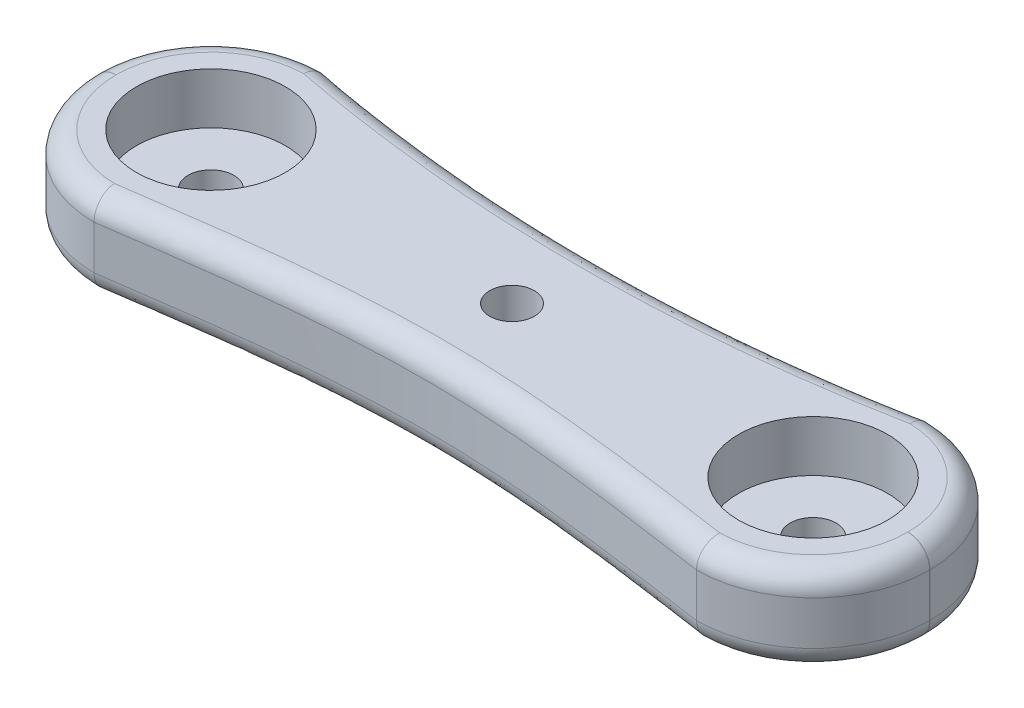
ISO-10303-21;
HEADER;
FILE_DESCRIPTION(('STEP AP214'),'2;1');
FILE_NAME('part.step','',(''),(''),'','','');
FILE_SCHEMA(('AUTOMOTIVE_DESIGN { 1 0 10303 214 1 1 1 1 }'));
ENDSEC;
DATA;
#1=APPLICATION_CONTEXT('core data for automotive mechanical design processes');
#2=APPLICATION_PROTOCOL_DEFINITION('international standard','automotive_design',2000,#1);
#3=PRODUCT_CONTEXT('',#1,'mechanical');
#4=PRODUCT('Part','Part','',(#3));
#5=PRODUCT_RELATED_PRODUCT_CATEGORY('part','',(#4));
#6=PRODUCT_DEFINITION_FORMATION('','',#4);
#7=PRODUCT_DEFINITION_CONTEXT('part definition',#1,'design');
#8=PRODUCT_DEFINITION('design','',#6,#7);
#9=PRODUCT_DEFINITION_SHAPE('','',#8);
#10=(LENGTH_UNIT() NAMED_UNIT(*) SI_UNIT(.MILLI.,.METRE.));
#11=(NAMED_UNIT(*) PLANE_ANGLE_UNIT() SI_UNIT($,.RADIAN.));
#12=(NAMED_UNIT(*) SI_UNIT($,.STERADIAN.) SOLID_ANGLE_UNIT());
#13=UNCERTAINTY_MEASURE_WITH_UNIT(LENGTH_MEASURE(1.E-05),#10,'distance_accuracy_value','');
#14=(GEOMETRIC_REPRESENTATION_CONTEXT(3) GLOBAL_UNCERTAINTY_ASSIGNED_CONTEXT((#13)) GLOBAL_UNIT_ASSIGNED_CONTEXT((#10,
#11,#12)) REPRESENTATION_CONTEXT('',''));
#15=CARTESIAN_POINT('',(0.,0.,0.));
#16=DIRECTION('',(0.,0.,1.));
#17=DIRECTION('',(1.,0.,0.));
#18=AXIS2_PLACEMENT_3D('',#15,#16,#17);
#19=CARTESIAN_POINT('',(-20.6399999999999,6.,-8.));
#20=CARTESIAN_POINT('',(0.,6.,-4.));
#21=CARTESIAN_POINT('',(20.6399999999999,6.,-8.));
#22=B_SPLINE_CURVE_WITH_KNOTS('',2,(#19,#20,#21),.UNSPECIFIED.,.F.,.F.,(3,3),(0.,1.),.UNSPECIFIED.);
#23=DIRECTION('',(0.,-1.,0.));
#24=VECTOR('',#23,1.);
#25=SURFACE_OF_LINEAR_EXTRUSION('',#22,#24);
#26=DIRECTION('',(0.,-1.,0.));
#27=VECTOR('',#26,1.);
#28=CARTESIAN_POINT('',(20.6399999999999,6.,-8.));
#29=LINE('',#28,#27);
#30=CARTESIAN_POINT('',(20.6399999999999,4.5,-8.));
#31=VERTEX_POINT('',#30);
#32=CARTESIAN_POINT('',(20.6399999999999,1.5,-8.));
#33=VERTEX_POINT('',#32);
#34=EDGE_CURVE('E158',#31,#33,#29,.T.);
#35=ORIENTED_EDGE('',*,*,#34,.T.);
#36=CARTESIAN_POINT('',(31.7291604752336,0.,-8.62115336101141));
#37=CARTESIAN_POINT('',(31.443772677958,0.,-10.0937543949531));
#38=CARTESIAN_POINT('',(31.443772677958,1.5,-10.0937543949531));
#39=CARTESIAN_POINT('',(28.127902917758,0.,-7.92323522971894));
#40=CARTESIAN_POINT('',(27.8425151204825,0.,-9.39583626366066));
#41=CARTESIAN_POINT('',(27.8425151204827,1.5,-9.39583626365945));
#42=CARTESIAN_POINT('',(24.5266453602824,0.,-7.22531709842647));
#43=CARTESIAN_POINT('',(24.2412575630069,0.,-8.69791813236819));
#44=CARTESIAN_POINT('',(24.2412575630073,1.5,-8.69791813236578));
#45=CARTESIAN_POINT('',(20.9253878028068,0.,-6.527398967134));
#46=CARTESIAN_POINT('',(20.6400000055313,0.,-8.00000000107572));
#47=CARTESIAN_POINT('',(20.640000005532,1.5,-8.0000000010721));
#48=CARTESIAN_POINT('',(20.1133693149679,0.,-6.37003505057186));
#49=CARTESIAN_POINT('',(19.8386604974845,0.,-7.84470555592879));
#50=CARTESIAN_POINT('',(19.8386604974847,1.5,-7.84470555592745));
#51=CARTESIAN_POINT('',(19.2996979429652,0.,-6.2215110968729));
#52=CARTESIAN_POINT('',(19.0357566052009,0.,-7.69814775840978));
#53=CARTESIAN_POINT('',(19.035756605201,1.5,-7.69814775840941));
#54=CARTESIAN_POINT('',(17.6689121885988,0.,-5.9423426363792));
#55=CARTESIAN_POINT('',(17.4266725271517,0.,-7.4226944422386));
#56=CARTESIAN_POINT('',(17.4266725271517,1.5,-7.42269444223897));
#57=CARTESIAN_POINT('',(16.8517964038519,0.,-5.81170632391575));
#58=CARTESIAN_POINT('',(16.6204910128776,0.,-7.29380701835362));
#59=CARTESIAN_POINT('',(16.6204910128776,1.5,-7.29380701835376));
#60=CARTESIAN_POINT('',(13.3808324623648,0.,-5.29638564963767));
#61=CARTESIAN_POINT('',(13.1962043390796,0.,-6.78541559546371));
#62=CARTESIAN_POINT('',(13.1962043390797,1.5,-6.78541559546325));
#63=CARTESIAN_POINT('',(10.7135014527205,0.,-4.99826649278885));
#64=CARTESIAN_POINT('',(10.5653129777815,0.,-6.49138605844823));
#65=CARTESIAN_POINT('',(10.5653129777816,1.5,-6.49138605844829));
#66=CARTESIAN_POINT('',(5.36401272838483,0.,-4.6000799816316));
#67=CARTESIAN_POINT('',(5.28951483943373,0.,-6.09868413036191));
#68=CARTESIAN_POINT('',(5.28951483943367,1.5,-6.09868413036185));
#69=CARTESIAN_POINT('',(2.68185414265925,0.,-4.50002438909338));
#70=CARTESIAN_POINT('',(2.64460723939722,0.,-6.00002334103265));
#71=CARTESIAN_POINT('',(2.64460723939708,1.5,-6.00002334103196));
#72=CARTESIAN_POINT('',(-1.77980630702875,0.,-4.49998381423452));
#73=CARTESIAN_POINT('',(-1.7550874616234,0.,-5.9999845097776));
#74=CARTESIAN_POINT('',(-1.7550874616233,1.5,-5.99998450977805));
#75=CARTESIAN_POINT('',(-3.55947852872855,0.,-4.5440241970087));
#76=CARTESIAN_POINT('',(-3.5100426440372,0.,-6.0434117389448));
#77=CARTESIAN_POINT('',(-3.51004264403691,1.5,-6.04341173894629));
#78=CARTESIAN_POINT('',(-7.11422012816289,0.,-4.71969403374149));
#79=CARTESIAN_POINT('',(-7.01559164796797,0.,-6.21665042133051));
#80=CARTESIAN_POINT('',(-7.01559164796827,1.5,-6.21665042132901));
#81=CARTESIAN_POINT('',(-8.88929032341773,0.,-4.85130668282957));
#82=CARTESIAN_POINT('',(-8.76618624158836,0.,-6.34644530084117));
#83=CARTESIAN_POINT('',(-8.76618624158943,1.5,-6.34644530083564));
#84=CARTESIAN_POINT('',(-12.3813231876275,0.,-5.19601180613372));
#85=CARTESIAN_POINT('',(-12.2104111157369,0.,-6.68643092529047));
#86=CARTESIAN_POINT('',(-12.2104111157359,1.5,-6.68643092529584));
#87=CARTESIAN_POINT('',(-14.0985227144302,0.,-5.40672289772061));
#88=CARTESIAN_POINT('',(-13.9042654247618,0.,-6.89427202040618));
#89=CARTESIAN_POINT('',(-13.9042654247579,1.5,-6.89427202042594));
#90=CARTESIAN_POINT('',(-17.5214747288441,0.,-5.9078040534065));
#91=CARTESIAN_POINT('',(-17.2811438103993,0.,-7.38861021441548));
#92=CARTESIAN_POINT('',(-17.2811438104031,1.5,-7.38861021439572));
#93=CARTESIAN_POINT('',(-19.2272258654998,0.,-6.19818335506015));
#94=CARTESIAN_POINT('',(-18.9641666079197,0.,-7.67511643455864));
#95=CARTESIAN_POINT('',(-18.964166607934,1.5,-7.67511643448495));
#96=CARTESIAN_POINT('',(-20.9253877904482,0.,-6.52739896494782));
#97=CARTESIAN_POINT('',(-20.6399999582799,0.,-7.99999999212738));
#98=CARTESIAN_POINT('',(-20.6399999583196,1.5,-7.99999999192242));
#99=CARTESIAN_POINT('',(-21.0229739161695,0.,-6.54631100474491));
#100=CARTESIAN_POINT('',(-20.7375860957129,0.,-8.01891203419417));
#101=CARTESIAN_POINT('',(-20.7375860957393,1.5,-8.01891203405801));
#102=CARTESIAN_POINT('',(-21.1205600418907,0.,-6.56522304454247));
#103=CARTESIAN_POINT('',(-20.835172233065,0.,-8.03782407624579));
#104=CARTESIAN_POINT('',(-20.8351722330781,1.5,-8.03782407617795));
#105=CARTESIAN_POINT('',(-35.1719446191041,0.,-9.28835958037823));
#106=CARTESIAN_POINT('',(-34.8865584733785,0.,-10.7609609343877));
#107=CARTESIAN_POINT('',(-34.8865584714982,1.5,-10.760960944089));
#108=CARTESIAN_POINT('',(-49.1257430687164,0.,-11.9925840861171));
#109=CARTESIAN_POINT('',(-48.8403569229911,0.,-13.4651854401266));
#110=CARTESIAN_POINT('',(-48.8403569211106,1.5,-13.4651854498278));
#111=CARTESIAN_POINT('',(-63.0795415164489,0.,-14.696808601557));
#112=CARTESIAN_POINT('',(-62.7941537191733,0.,-16.1694096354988));
#113=CARTESIAN_POINT('',(-62.7941537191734,1.5,-16.1694096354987));
#114=(BOUNDED_SURFACE() B_SPLINE_SURFACE(3,2,((#36,#37,#38),(#39,#40,#41),(#42,#43,#44),(#45,
#46,#47),(#48,#49,#50),(#51,#52,#53),(#54,#55,#56),(#57,#58,#59),(#60,#61,#62),(#63,#64,#65),
(#66,#67,#68),(#69,#70,#71),(#72,#73,#74),(#75,#76,#77),(#78,#79,#80),(#81,#82,#83),(#84,#85,
#86),(#87,#88,#89),(#90,#91,#92),(#93,#94,#95),(#96,#97,#98),(#99,#100,#101),(#102,#103,#104),
(#105,#106,#107),(#108,#109,#110),(#111,#112,#113)),.UNSPECIFIED.,.F.,.F.,
.F.) B_SPLINE_SURFACE_WITH_KNOTS((4,3,2,2,2,2,2,2,2,3,2,4),(3,3),(0.,11.0047858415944,
13.4859938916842,15.9683348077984,24.0122589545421,32.0566607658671,37.3953094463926,
42.7329339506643,47.9212994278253,53.1102667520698,53.4084721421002,96.0487335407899),(0.,1.),
.UNSPECIFIED.) GEOMETRIC_REPRESENTATION_ITEM() RATIONAL_B_SPLINE_SURFACE(((1.,0.707106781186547,
1.),(1.,0.707106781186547,1.),(1.,0.707106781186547,1.),(1.,0.707106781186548,1.),(1.,
0.707106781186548,1.),(1.,0.707106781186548,1.),(1.,0.707106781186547,1.),(1.,0.707106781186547,
1.),(1.,0.707106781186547,1.),(1.,0.707106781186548,1.),(1.,0.707106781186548,1.),(1.,
0.707106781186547,1.),(1.,0.707106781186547,1.),(1.,0.707106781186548,1.),(1.,0.707106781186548,
1.),(1.,0.707106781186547,1.),(1.,0.707106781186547,1.),(1.,0.707106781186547,1.),(1.,
0.707106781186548,1.),(1.,0.707106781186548,1.),(1.,0.707106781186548,1.),(1.,0.707106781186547,
1.),(1.,0.707106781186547,1.),(1.,0.707106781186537,1.),(1.,0.707106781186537,1.),(1.,
0.707106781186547,1.))) REPRESENTATION_ITEM('') SURFACE());
#115=CARTESIAN_POINT('',(31.443772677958,1.5,-10.0937543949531));
#116=CARTESIAN_POINT('',(27.8425151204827,1.5,-9.39583626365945));
#117=CARTESIAN_POINT('',(24.2412575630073,1.5,-8.69791813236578));
#118=CARTESIAN_POINT('',(20.640000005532,1.5,-8.0000000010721));
#119=CARTESIAN_POINT('',(19.8386604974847,1.5,-7.84470555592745));
#120=CARTESIAN_POINT('',(19.035756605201,1.5,-7.69814775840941));
#121=CARTESIAN_POINT('',(17.4266725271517,1.5,-7.42269444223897));
#122=CARTESIAN_POINT('',(16.6204910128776,1.5,-7.29380701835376));
#123=CARTESIAN_POINT('',(13.1962043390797,1.5,-6.78541559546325));
#124=CARTESIAN_POINT('',(10.5653129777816,1.5,-6.49138605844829));
#125=CARTESIAN_POINT('',(5.28951483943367,1.5,-6.09868413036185));
#126=CARTESIAN_POINT('',(2.64460723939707,1.5,-6.00002334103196));
#127=CARTESIAN_POINT('',(-1.7550874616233,1.5,-5.99998450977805));
#128=CARTESIAN_POINT('',(-3.51004264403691,1.5,-6.04341173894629));
#129=CARTESIAN_POINT('',(-7.01559164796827,1.5,-6.21665042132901));
#130=CARTESIAN_POINT('',(-8.76618624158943,1.5,-6.34644530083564));
#131=CARTESIAN_POINT('',(-12.2104111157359,1.5,-6.68643092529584));
#132=CARTESIAN_POINT('',(-13.9042654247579,1.5,-6.89427202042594));
#133=CARTESIAN_POINT('',(-17.2811438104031,1.5,-7.38861021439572));
#134=CARTESIAN_POINT('',(-18.964166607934,1.5,-7.67511643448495));
#135=CARTESIAN_POINT('',(-20.6399999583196,1.5,-7.99999999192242));
#136=CARTESIAN_POINT('',(-20.7375860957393,1.5,-8.01891203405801));
#137=CARTESIAN_POINT('',(-20.8351722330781,1.5,-8.03782407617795));
#138=CARTESIAN_POINT('',(-34.886558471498,1.5,-10.760960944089));
#139=CARTESIAN_POINT('',(-48.8403569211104,1.5,-13.4651854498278));
#140=CARTESIAN_POINT('',(-62.7941537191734,1.5,-16.1694096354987));
#141=B_SPLINE_CURVE_WITH_KNOTS('',3,(#115,#116,#117,#118,#119,#120,#121,#122,#123,#124,#125,
#126,#127,#128,#129,#130,#131,#132,#133,#134,#135,#136,#137,#138,#139,#140),.UNSPECIFIED.,.F.,
.F.,(4,3,2,2,2,2,2,2,2,3,2,4),(0.,11.0047858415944,13.4859938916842,15.9683348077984,
24.0122589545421,32.0566607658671,37.3953094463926,42.7329339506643,47.9212994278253,
53.1102667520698,53.4084721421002,96.0487335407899),.UNSPECIFIED.);
#142=CARTESIAN_POINT('',(-20.6399999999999,1.5,-8.));
#143=VERTEX_POINT('',#142);
#144=EDGE_CURVE('E432',#33,#143,#141,.T.);
#145=ORIENTED_EDGE('',*,*,#144,.T.);
#146=DIRECTION('',(0.,-1.,0.));
#147=VECTOR('',#146,1.);
#148=CARTESIAN_POINT('',(-20.6399999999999,6.,-8.));
#149=LINE('',#148,#147);
#150=CARTESIAN_POINT('',(-20.6399999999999,4.5,-8.));
#151=VERTEX_POINT('',#150);
#152=EDGE_CURVE('E266',#151,#143,#149,.T.);
#153=ORIENTED_EDGE('',*,*,#152,.F.);
#154=CARTESIAN_POINT('',(-31.7291604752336,6.,-8.62115336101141));
#155=CARTESIAN_POINT('',(-31.443772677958,6.,-10.0937543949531));
#156=CARTESIAN_POINT('',(-31.443772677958,4.5,-10.0937543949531));
#157=CARTESIAN_POINT('',(-28.127902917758,6.,-7.92323522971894));
#158=CARTESIAN_POINT('',(-27.8425151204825,6.,-9.39583626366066));
#159=CARTESIAN_POINT('',(-27.8425151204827,4.5,-9.39583626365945));
#160=CARTESIAN_POINT('',(-24.5266453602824,6.,-7.22531709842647));
#161=CARTESIAN_POINT('',(-24.2412575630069,6.,-8.69791813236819));
#162=CARTESIAN_POINT('',(-24.2412575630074,4.5,-8.69791813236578));
#163=CARTESIAN_POINT('',(-20.9253878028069,6.,-6.527398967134));
#164=CARTESIAN_POINT('',(-20.6400000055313,6.,-8.00000000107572));
#165=CARTESIAN_POINT('',(-20.640000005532,4.5,-8.00000000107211));
#166=CARTESIAN_POINT('',(-20.1133693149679,6.,-6.37003505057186));
#167=CARTESIAN_POINT('',(-19.8386605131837,6.,-7.84470555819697));
#168=CARTESIAN_POINT('',(-19.838660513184,4.5,-7.84470555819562));
#169=CARTESIAN_POINT('',(-19.2996979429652,6.,-6.2215110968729));
#170=CARTESIAN_POINT('',(-19.0357566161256,6.,-7.69814776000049));
#171=CARTESIAN_POINT('',(-19.0357566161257,4.5,-7.69814776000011));
#172=CARTESIAN_POINT('',(-17.6689121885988,6.,-5.9423426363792));
#173=CARTESIAN_POINT('',(-17.4266725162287,6.,-7.42269444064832));
#174=CARTESIAN_POINT('',(-17.4266725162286,4.5,-7.42269444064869));
#175=CARTESIAN_POINT('',(-16.8517964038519,6.,-5.81170632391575));
#176=CARTESIAN_POINT('',(-16.6204909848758,6.,-7.29380701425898));
#177=CARTESIAN_POINT('',(-16.6204909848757,4.5,-7.29380701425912));
#178=CARTESIAN_POINT('',(-13.3808324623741,6.,-5.29638564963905));
#179=CARTESIAN_POINT('',(-13.1962042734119,6.,-6.78541558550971));
#180=CARTESIAN_POINT('',(-13.196204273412,4.5,-6.78541558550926));
#181=CARTESIAN_POINT('',(-10.7135014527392,6.,-4.99826649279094));
#182=CARTESIAN_POINT('',(-10.565312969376,6.,-6.49138605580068));
#183=CARTESIAN_POINT('',(-10.5653129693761,4.5,-6.49138605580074));
#184=CARTESIAN_POINT('',(-5.36401272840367,6.,-4.6000799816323));
#185=CARTESIAN_POINT('',(-5.28951484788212,6.,-6.09868413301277));
#186=CARTESIAN_POINT('',(-5.28951484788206,4.5,-6.09868413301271));
#187=CARTESIAN_POINT('',(-2.68185414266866,6.,-4.50002438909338));
#188=CARTESIAN_POINT('',(-2.6446072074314,6.,-6.00002334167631));
#189=CARTESIAN_POINT('',(-2.64460720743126,4.5,-6.00002334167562));
#190=CARTESIAN_POINT('',(1.77980630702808,6.,-4.49998381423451));
#191=CARTESIAN_POINT('',(1.75508748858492,6.,-5.99998450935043));
#192=CARTESIAN_POINT('',(1.75508748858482,4.5,-5.99998450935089));
#193=CARTESIAN_POINT('',(3.55947852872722,6.,-4.54402419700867));
#194=CARTESIAN_POINT('',(3.51004264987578,6.,-6.04341173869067));
#195=CARTESIAN_POINT('',(3.51004264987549,4.5,-6.04341173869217));
#196=CARTESIAN_POINT('',(7.11422012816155,6.,-4.71969403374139));
#197=CARTESIAN_POINT('',(7.01559164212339,6.,-6.21665042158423));
#198=CARTESIAN_POINT('',(7.01559164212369,4.5,-6.21665042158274));
#199=CARTESIAN_POINT('',(8.88929032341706,6.,-4.8513066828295));
#200=CARTESIAN_POINT('',(8.76618624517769,6.,-6.34644530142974));
#201=CARTESIAN_POINT('',(8.76618624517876,4.5,-6.34644530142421));
#202=CARTESIAN_POINT('',(12.3813231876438,6.,-5.19601180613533));
#203=CARTESIAN_POINT('',(12.21041112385,6.,-6.68643092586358));
#204=CARTESIAN_POINT('',(12.210411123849,4.5,-6.68643092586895));
#205=CARTESIAN_POINT('',(14.0985227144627,6.,-5.4067228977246));
#206=CARTESIAN_POINT('',(13.9042654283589,6.,-6.89427202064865));
#207=CARTESIAN_POINT('',(13.904265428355,4.5,-6.89427202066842));
#208=CARTESIAN_POINT('',(17.5214747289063,6.,-5.90780405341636));
#209=CARTESIAN_POINT('',(17.2811438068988,6.,-7.38861021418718));
#210=CARTESIAN_POINT('',(17.2811438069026,4.5,-7.38861021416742));
#211=CARTESIAN_POINT('',(19.2272258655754,6.,-6.19818335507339));
#212=CARTESIAN_POINT('',(18.9641666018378,6.,-7.67511643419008));
#213=CARTESIAN_POINT('',(18.9641666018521,4.5,-7.6751164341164));
#214=CARTESIAN_POINT('',(20.925387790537,6.,-6.52739896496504));
#215=CARTESIAN_POINT('',(20.6399999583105,6.,-7.9999999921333));
#216=CARTESIAN_POINT('',(20.6399999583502,4.5,-7.99999999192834));
#217=CARTESIAN_POINT('',(21.0229739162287,6.,-6.54631100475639));
#218=CARTESIAN_POINT('',(20.7375860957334,6.,-8.01891203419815));
#219=CARTESIAN_POINT('',(20.7375860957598,4.5,-8.01891203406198));
#220=CARTESIAN_POINT('',(21.1205600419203,6.,-6.56522304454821));
#221=CARTESIAN_POINT('',(20.8351722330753,6.,-8.03782407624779));
#222=CARTESIAN_POINT('',(20.8351722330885,4.5,-8.03782407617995));
#223=CARTESIAN_POINT('',(35.1719446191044,6.,-9.28835958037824));
#224=CARTESIAN_POINT('',(34.8865584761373,6.,-10.7609609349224));
#225=CARTESIAN_POINT('',(34.8865584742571,4.5,-10.7609609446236));
#226=CARTESIAN_POINT('',(49.1257430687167,6.,-11.9925840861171));
#227=CARTESIAN_POINT('',(48.8403569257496,6.,-13.4651854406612));
#228=CARTESIAN_POINT('',(48.8403569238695,4.5,-13.4651854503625));
#229=CARTESIAN_POINT('',(63.0795415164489,6.,-14.696808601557));
#230=CARTESIAN_POINT('',(62.7941537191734,6.,-16.1694096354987));
#231=CARTESIAN_POINT('',(62.7941537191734,4.5,-16.1694096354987));
#232=(BOUNDED_SURFACE() B_SPLINE_SURFACE(3,2,((#154,#155,#156),(#157,#158,#159),(#160,#161,
#162),(#163,#164,#165),(#166,#167,#168),(#169,#170,#171),(#172,#173,#174),(#175,#176,#177),
(#178,#179,#180),(#181,#182,#183),(#184,#185,#186),(#187,#188,#189),(#190,#191,#192),(#193,#194,
#195),(#196,#197,#198),(#199,#200,#201),(#202,#203,#204),(#205,#206,#207),(#208,#209,#210),
(#211,#212,#213),(#214,#215,#216),(#217,#218,#219),(#220,#221,#222),(#223,#224,#225),(#226,#227,
#228),(#229,#230,#231)),.UNSPECIFIED.,.F.,.F.,.F.) B_SPLINE_SURFACE_WITH_KNOTS((4,3,2,2,2,2,2,2,
2,3,2,4),(3,3),(0.,11.0047858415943,13.4859938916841,15.9683348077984,24.0122589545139,
32.0566607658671,37.3953094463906,42.7329339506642,47.9212994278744,53.1102667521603,
53.4084721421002,96.0487335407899),(0.,1.),
.UNSPECIFIED.) GEOMETRIC_REPRESENTATION_ITEM() RATIONAL_B_SPLINE_SURFACE(((1.,0.707106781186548,
1.),(1.,0.707106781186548,1.),(1.,0.707106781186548,1.),(1.,0.707106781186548,1.),(1.,
0.707106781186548,1.),(1.,0.707106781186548,1.),(1.,0.707106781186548,1.),(1.,0.707106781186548,
1.),(1.,0.707106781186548,1.),(1.,0.707106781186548,1.),(1.,0.707106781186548,1.),(1.,
0.707106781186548,1.),(1.,0.707106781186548,1.),(1.,0.707106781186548,1.),(1.,0.707106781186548,
1.),(1.,0.707106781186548,1.),(1.,0.707106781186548,1.),(1.,0.707106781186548,1.),(1.,
0.707106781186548,1.),(1.,0.707106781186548,1.),(1.,0.707106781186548,1.),(1.,0.707106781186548,
1.),(1.,0.707106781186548,1.),(1.,0.707106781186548,1.),(1.,0.707106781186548,1.),(1.,
0.707106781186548,1.))) REPRESENTATION_ITEM('') SURFACE());
#233=CARTESIAN_POINT('',(-31.443772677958,4.5,-10.0937543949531));
#234=CARTESIAN_POINT('',(-27.8425151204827,4.5,-9.39583626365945));
#235=CARTESIAN_POINT('',(-24.2412575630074,4.5,-8.69791813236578));
#236=CARTESIAN_POINT('',(-20.640000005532,4.5,-8.00000000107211));
#237=CARTESIAN_POINT('',(-19.838660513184,4.5,-7.84470555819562));
#238=CARTESIAN_POINT('',(-19.0357566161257,4.5,-7.69814776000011));
#239=CARTESIAN_POINT('',(-17.4266725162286,4.5,-7.42269444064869));
#240=CARTESIAN_POINT('',(-16.6204909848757,4.5,-7.29380701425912));
#241=CARTESIAN_POINT('',(-13.196204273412,4.5,-6.78541558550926));
#242=CARTESIAN_POINT('',(-10.5653129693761,4.5,-6.49138605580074));
#243=CARTESIAN_POINT('',(-5.28951484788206,4.5,-6.09868413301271));
#244=CARTESIAN_POINT('',(-2.64460720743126,4.5,-6.00002334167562));
#245=CARTESIAN_POINT('',(1.75508748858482,4.5,-5.99998450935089));
#246=CARTESIAN_POINT('',(3.51004264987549,4.5,-6.04341173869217));
#247=CARTESIAN_POINT('',(7.01559164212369,4.5,-6.21665042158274));
#248=CARTESIAN_POINT('',(8.76618624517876,4.5,-6.34644530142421));
#249=CARTESIAN_POINT('',(12.210411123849,4.5,-6.68643092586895));
#250=CARTESIAN_POINT('',(13.904265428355,4.5,-6.89427202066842));
#251=CARTESIAN_POINT('',(17.2811438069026,4.5,-7.38861021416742));
#252=CARTESIAN_POINT('',(18.9641666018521,4.5,-7.6751164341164));
#253=CARTESIAN_POINT('',(20.6399999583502,4.5,-7.99999999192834));
#254=CARTESIAN_POINT('',(20.7375860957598,4.5,-8.01891203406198));
#255=CARTESIAN_POINT('',(20.8351722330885,4.5,-8.03782407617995));
#256=CARTESIAN_POINT('',(34.8865584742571,4.5,-10.7609609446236));
#257=CARTESIAN_POINT('',(48.8403569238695,4.5,-13.4651854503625));
#258=CARTESIAN_POINT('',(62.7941537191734,4.5,-16.1694096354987));
#259=B_SPLINE_CURVE_WITH_KNOTS('',3,(#233,#234,#235,#236,#237,#238,#239,#240,#241,#242,#243,
#244,#245,#246,#247,#248,#249,#250,#251,#252,#253,#254,#255,#256,#257,#258),.UNSPECIFIED.,.F.,
.F.,(4,3,2,2,2,2,2,2,2,3,2,4),(0.,11.0047858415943,13.4859938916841,15.9683348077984,
24.0122589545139,32.0566607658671,37.3953094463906,42.7329339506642,47.9212994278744,
53.1102667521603,53.4084721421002,96.0487335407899),.UNSPECIFIED.);
#260=EDGE_CURVE('E400',#151,#31,#259,.T.);
#261=ORIENTED_EDGE('',*,*,#260,.T.);
#262=EDGE_LOOP('',(#35,#145,#153,#261));
#263=FACE_BOUND('',#262,.T.);
#264=ADVANCED_FACE('F37',(#263),#25,.T.);
#265=CARTESIAN_POINT('',(-20.64,6.,-0.00999999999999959));
#266=DIRECTION('',(0.,-1.,0.));
#267=DIRECTION('',(0.,0.,-1.));
#268=AXIS2_PLACEMENT_3D('',#265,#266,#267);
#269=CYLINDRICAL_SURFACE('',#268,7.99);
#270=ORIENTED_EDGE('',*,*,#152,.T.);
#271=CARTESIAN_POINT('',(-20.64,1.5,-0.00999999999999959));
#272=DIRECTION('',(0.,1.,0.));
#273=DIRECTION('',(0.,0.,1.));
#274=AXIS2_PLACEMENT_3D('',#271,#272,#273);
#275=CIRCLE('',#274,7.99);
#276=CARTESIAN_POINT('',(-28.63,1.5,-0.00999999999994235));
#277=VERTEX_POINT('',#276);
#278=EDGE_CURVE('E545',#143,#277,#275,.T.);
#279=ORIENTED_EDGE('',*,*,#278,.T.);
#280=DIRECTION('',(0.,-1.,0.));
#281=VECTOR('',#280,1.);
#282=CARTESIAN_POINT('',(-28.63,6.,-0.00999999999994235));
#283=LINE('',#282,#281);
#284=CARTESIAN_POINT('',(-28.63,4.5,-0.00999999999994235));
#285=VERTEX_POINT('',#284);
#286=EDGE_CURVE('E263',#285,#277,#283,.T.);
#287=ORIENTED_EDGE('',*,*,#286,.F.);
#288=CARTESIAN_POINT('',(-20.64,4.5,-0.00999999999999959));
#289=DIRECTION('',(0.,1.,0.));
#290=DIRECTION('',(0.,0.,1.));
#291=AXIS2_PLACEMENT_3D('',#288,#289,#290);
#292=CIRCLE('',#291,7.99);
#293=EDGE_CURVE('E541',#285,#151,#292,.F.);
#294=ORIENTED_EDGE('',*,*,#293,.T.);
#295=EDGE_LOOP('',(#270,#279,#287,#294));
#296=FACE_BOUND('',#295,.T.);
#297=ADVANCED_FACE('F440',(#296),#269,.T.);
#298=CARTESIAN_POINT('',(-28.63,6.,0.));
#299=DIRECTION('',(-1.,0.,0.));
#300=DIRECTION('',(0.,0.,1.));
#301=AXIS2_PLACEMENT_3D('',#298,#299,#300);
#302=PLANE('',#301);
#303=ORIENTED_EDGE('',*,*,#286,.T.);
#304=DIRECTION('',(0.,0.,-1.));
#305=VECTOR('',#304,1.);
#306=CARTESIAN_POINT('',(-28.63,1.5,0.00999999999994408));
#307=LINE('',#306,#305);
#308=CARTESIAN_POINT('',(-28.63,1.5,0.00999999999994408));
#309=VERTEX_POINT('',#308);
#310=EDGE_CURVE('E520',#277,#309,#307,.F.);
#311=ORIENTED_EDGE('',*,*,#310,.T.);
#312=DIRECTION('',(0.,-1.,0.));
#313=VECTOR('',#312,1.);
#314=CARTESIAN_POINT('',(-28.63,6.,0.00999999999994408));
#315=LINE('',#314,#313);
#316=CARTESIAN_POINT('',(-28.63,4.5,0.00999999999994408));
#317=VERTEX_POINT('',#316);
#318=EDGE_CURVE('E261',#317,#309,#315,.T.);
#319=ORIENTED_EDGE('',*,*,#318,.F.);
#320=DIRECTION('',(0.,0.,-1.));
#321=VECTOR('',#320,1.);
#322=CARTESIAN_POINT('',(-28.63,4.5,0.));
#323=LINE('',#322,#321);
#324=EDGE_CURVE('E517',#317,#285,#323,.T.);
#325=ORIENTED_EDGE('',*,*,#324,.T.);
#326=EDGE_LOOP('',(#303,#311,#319,#325));
#327=FACE_BOUND('',#326,.T.);
#328=ADVANCED_FACE('F548',(#327),#302,.T.);
#329=CARTESIAN_POINT('',(-20.64,6.,0.0100000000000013));
#330=DIRECTION('',(0.,-1.,0.));
#331=DIRECTION('',(0.,0.,-1.));
#332=AXIS2_PLACEMENT_3D('',#329,#330,#331);
#333=CYLINDRICAL_SURFACE('',#332,7.99);
#334=ORIENTED_EDGE('',*,*,#318,.T.);
#335=CARTESIAN_POINT('',(-20.64,1.5,0.0100000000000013));
#336=DIRECTION('',(0.,1.,0.));
#337=DIRECTION('',(0.,0.,1.));
#338=AXIS2_PLACEMENT_3D('',#335,#336,#337);
#339=CIRCLE('',#338,7.99);
#340=CARTESIAN_POINT('',(-20.64,1.5,8.));
#341=VERTEX_POINT('',#340);
#342=EDGE_CURVE('E54',#309,#341,#339,.T.);
#343=ORIENTED_EDGE('',*,*,#342,.T.);
#344=DIRECTION('',(0.,-1.,0.));
#345=VECTOR('',#344,1.);
#346=CARTESIAN_POINT('',(-20.64,6.,8.));
#347=LINE('',#346,#345);
#348=CARTESIAN_POINT('',(-20.64,4.5,8.));
#349=VERTEX_POINT('',#348);
#350=EDGE_CURVE('E259',#349,#341,#347,.T.);
#351=ORIENTED_EDGE('',*,*,#350,.F.);
#352=CARTESIAN_POINT('',(-20.64,4.5,0.0100000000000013));
#353=DIRECTION('',(0.,1.,0.));
#354=DIRECTION('',(0.,0.,1.));
#355=AXIS2_PLACEMENT_3D('',#352,#353,#354);
#356=CIRCLE('',#355,7.99);
#357=EDGE_CURVE('E553',#349,#317,#356,.F.);
#358=ORIENTED_EDGE('',*,*,#357,.T.);
#359=EDGE_LOOP('',(#334,#343,#351,#358));
#360=FACE_BOUND('',#359,.T.);
#361=ADVANCED_FACE('F227',(#360),#333,.T.);
#362=CARTESIAN_POINT('',(-20.6399999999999,6.,8.));
#363=CARTESIAN_POINT('',(-13.76,6.,7.));
#364=CARTESIAN_POINT('',(0.,6.,5.));
#365=CARTESIAN_POINT('',(13.76,6.,7.));
#366=CARTESIAN_POINT('',(20.6399999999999,6.,8.));
#367=B_SPLINE_CURVE_WITH_KNOTS('',3,(#362,#363,#364,#365,#366),.UNSPECIFIED.,.F.,.F.,(4,1,4),
(0.,0.5,1.),.UNSPECIFIED.);
#368=DIRECTION('',(0.,-1.,0.));
#369=VECTOR('',#368,1.);
#370=SURFACE_OF_LINEAR_EXTRUSION('',#367,#369);
#371=ORIENTED_EDGE('',*,*,#350,.T.);
#372=CARTESIAN_POINT('',(-31.4183089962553,0.,8.05085277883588));
#373=CARTESIAN_POINT('',(-31.2025528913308,0.,9.5352547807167));
#374=CARTESIAN_POINT('',(-31.2025528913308,1.5,9.5352547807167));
#375=CARTESIAN_POINT('',(-27.8974580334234,0.,7.5391011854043));
#376=CARTESIAN_POINT('',(-27.6817019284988,0.,9.02350318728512));
#377=CARTESIAN_POINT('',(-27.6817019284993,1.5,9.02350318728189));
#378=CARTESIAN_POINT('',(-24.3766070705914,0.,7.02734959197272));
#379=CARTESIAN_POINT('',(-24.1608509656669,0.,8.51175159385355));
#380=CARTESIAN_POINT('',(-24.1608509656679,1.5,8.51175159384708));
#381=CARTESIAN_POINT('',(-20.8557561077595,0.,6.51559799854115));
#382=CARTESIAN_POINT('',(-20.640000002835,0.,8.00000000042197));
#383=CARTESIAN_POINT('',(-20.6400000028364,1.5,8.00000000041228));
#384=CARTESIAN_POINT('',(-20.0107840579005,0.,6.39278058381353));
#385=CARTESIAN_POINT('',(-19.7950306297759,0.,7.87717849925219));
#386=CARTESIAN_POINT('',(-19.7950306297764,1.5,7.87717849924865));
#387=CARTESIAN_POINT('',(-19.1658012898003,0.,6.26996536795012));
#388=CARTESIAN_POINT('',(-18.9511075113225,0.,7.75452185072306));
#389=CARTESIAN_POINT('',(-18.9511075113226,1.5,7.7545218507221));
#390=CARTESIAN_POINT('',(-17.4738277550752,0.,6.02774085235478));
#391=CARTESIAN_POINT('',(-17.2633755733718,0.,7.51290673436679));
#392=CARTESIAN_POINT('',(-17.2633755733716,1.5,7.51290673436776));
#393=CARTESIAN_POINT('',(-16.626836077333,0.,5.90833794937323));
#394=CARTESIAN_POINT('',(-16.4195695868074,0.,7.39395517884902));
#395=CARTESIAN_POINT('',(-16.4195695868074,1.5,7.39395517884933));
#396=CARTESIAN_POINT('',(-14.4699372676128,0.,5.61370249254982));
#397=CARTESIAN_POINT('',(-14.2734897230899,0.,7.10079798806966));
#398=CARTESIAN_POINT('',(-14.27348972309,1.5,7.10079798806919));
#399=CARTESIAN_POINT('',(-13.159326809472,0.,5.44350970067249));
#400=CARTESIAN_POINT('',(-12.9719902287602,0.,6.9318117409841));
#401=CARTESIAN_POINT('',(-12.9719902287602,1.5,6.93181174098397));
#402=CARTESIAN_POINT('',(-10.5342226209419,0.,5.1340011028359));
#403=CARTESIAN_POINT('',(-10.3702815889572,0.,6.62506208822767));
#404=CARTESIAN_POINT('',(-10.3702815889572,1.5,6.6250620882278));
#405=CARTESIAN_POINT('',(-9.2197286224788,0.,4.99468748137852));
#406=CARTESIAN_POINT('',(-9.07007254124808,0.,6.4873008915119));
#407=CARTESIAN_POINT('',(-9.07007254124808,1.5,6.48730089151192));
#408=CARTESIAN_POINT('',(-7.24618794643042,0.,4.81935868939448));
#409=CARTESIAN_POINT('',(-7.12189455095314,0.,6.31422369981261));
#410=CARTESIAN_POINT('',(-7.12189455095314,1.5,6.3142236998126));
#411=CARTESIAN_POINT('',(-6.58863445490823,0.,4.76655517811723));
#412=CARTESIAN_POINT('',(-6.47344119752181,0.,6.26215725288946));
#413=CARTESIAN_POINT('',(-6.47344119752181,1.5,6.26215725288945));
#414=CARTESIAN_POINT('',(-5.2726011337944,0.,4.67382003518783));
#415=CARTESIAN_POINT('',(-5.17692061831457,0.,6.17079749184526));
#416=CARTESIAN_POINT('',(-5.17692061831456,1.5,6.17079749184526));
#417=CARTESIAN_POINT('',(-4.61412129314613,0.,4.63388855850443));
#418=CARTESIAN_POINT('',(-4.52885339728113,0.,6.13150433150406));
#419=CARTESIAN_POINT('',(-4.52885339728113,1.5,6.13150433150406));
#420=CARTESIAN_POINT('',(-3.29656693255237,0.,4.56864039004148));
#421=CARTESIAN_POINT('',(-3.23344635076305,0.,6.06735251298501));
#422=CARTESIAN_POINT('',(-3.23344635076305,1.5,6.06735251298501));
#423=CARTESIAN_POINT('',(-2.63749258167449,0.,4.54332038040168));
#424=CARTESIAN_POINT('',(-2.58610639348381,0.,6.04249057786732));
#425=CARTESIAN_POINT('',(-2.58610639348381,1.5,6.04249057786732));
#426=CARTESIAN_POINT('',(-1.64858362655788,0.,4.51757985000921));
#427=CARTESIAN_POINT('',(-1.61573152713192,0.,6.0172329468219));
#428=CARTESIAN_POINT('',(-1.61573152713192,1.5,6.0172329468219));
#429=CARTESIAN_POINT('',(-1.31890112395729,0.,4.51103959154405));
#430=CARTESIAN_POINT('',(-1.29238240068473,0.,6.01081961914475));
#431=CARTESIAN_POINT('',(-1.29238240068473,1.5,6.01081961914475));
#432=CARTESIAN_POINT('',(-0.659478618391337,0.,4.50224969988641));
#433=CARTESIAN_POINT('',(-0.646011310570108,0.,6.00220318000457));
#434=CARTESIAN_POINT('',(-0.646011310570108,1.5,6.00220318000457));
#435=CARTESIAN_POINT('',(-0.32973861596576,0.,4.50000002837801));
#436=CARTESIAN_POINT('',(-0.322989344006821,0.,6.00000003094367));
#437=CARTESIAN_POINT('',(-0.322989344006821,1.5,6.00000003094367));
#438=CARTESIAN_POINT('',(0.219841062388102,0.,4.49999998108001));
#439=CARTESIAN_POINT('',(0.215341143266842,0.,5.99999997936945));
#440=CARTESIAN_POINT('',(0.215341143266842,1.5,5.99999997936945));
#441=CARTESIAN_POINT('',(0.439681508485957,0.,4.50099994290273));
#442=CARTESIAN_POINT('',(0.430667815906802,0.,6.00097925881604));
#443=CARTESIAN_POINT('',(0.430667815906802,1.5,6.00097925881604));
#444=CARTESIAN_POINT('',(0.879344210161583,0.,4.50493802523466));
#445=CARTESIAN_POINT('',(0.861487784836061,0.,6.00483837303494));
#446=CARTESIAN_POINT('',(0.86148778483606,1.5,6.00483837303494));
#447=CARTESIAN_POINT('',(1.09916646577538,0.,4.50787614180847));
#448=CARTESIAN_POINT('',(1.07698108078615,0.,6.0077182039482));
#449=CARTESIAN_POINT('',(1.07698108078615,1.5,6.00771820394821));
#450=CARTESIAN_POINT('',(1.75858311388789,0.,4.51950449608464));
#451=CARTESIAN_POINT('',(1.72361244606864,0.,6.01912086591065));
#452=CARTESIAN_POINT('',(1.72361244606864,1.5,6.01912086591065));
#453=CARTESIAN_POINT('',(2.19813040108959,0.,4.53100874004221));
#454=CARTESIAN_POINT('',(2.15490494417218,0.,6.03040686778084));
#455=CARTESIAN_POINT('',(2.15490494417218,1.5,6.03040686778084));
#456=CARTESIAN_POINT('',(3.0770152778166,0.,4.56101784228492));
#457=CARTESIAN_POINT('',(3.01786595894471,0.,6.05987243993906));
#458=CARTESIAN_POINT('',(3.01786595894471,1.5,6.05987243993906));
#459=CARTESIAN_POINT('',(3.51635284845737,0.,4.57952324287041));
#460=CARTESIAN_POINT('',(3.44953450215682,0.,6.0780525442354));
#461=CARTESIAN_POINT('',(3.44953450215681,1.5,6.0780525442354));
#462=CARTESIAN_POINT('',(4.394702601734,0.,4.62302389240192));
#463=CARTESIAN_POINT('',(4.31312630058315,0.,6.1208221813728));
#464=CARTESIAN_POINT('',(4.31312630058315,1.5,6.12082218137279));
#465=CARTESIAN_POINT('',(4.83371478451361,0.,4.64801913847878));
#466=CARTESIAN_POINT('',(4.74504955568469,0.,6.14541171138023));
#467=CARTESIAN_POINT('',(4.74504955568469,1.5,6.14541171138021));
#468=CARTESIAN_POINT('',(6.1515860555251,0.,4.73206055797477));
#469=CARTESIAN_POINT('',(6.04250974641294,0.,6.22815184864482));
#470=CARTESIAN_POINT('',(6.04250974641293,1.5,6.22815184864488));
#471=CARTESIAN_POINT('',(7.02987823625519,0.,4.80011133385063));
#472=CARTESIAN_POINT('',(6.9083608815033,0.,6.2952239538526));
#473=CARTESIAN_POINT('',(6.90836088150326,1.5,6.29522395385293));
#474=CARTESIAN_POINT('',(8.78462566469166,0.,4.95606366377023));
#475=CARTESIAN_POINT('',(8.64056510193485,0.,6.4491726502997));
#476=CARTESIAN_POINT('',(8.6405651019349,1.5,6.44917265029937));
#477=CARTESIAN_POINT('',(9.66108096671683,0.,5.04396462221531));
#478=CARTESIAN_POINT('',(9.50691817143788,0.,6.53604864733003));
#479=CARTESIAN_POINT('',(9.50691817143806,1.5,6.53604864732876));
#480=CARTESIAN_POINT('',(11.4003932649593,0.,5.23422422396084));
#481=CARTESIAN_POINT('',(11.2284596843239,0.,6.72436439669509));
#482=CARTESIAN_POINT('',(11.2284596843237,1.5,6.72436439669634));
#483=CARTESIAN_POINT('',(12.2632737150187,0.,5.33637101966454));
#484=CARTESIAN_POINT('',(12.0836404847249,0.,6.82559105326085));
#485=CARTESIAN_POINT('',(12.0836404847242,1.5,6.82559105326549));
#486=CARTESIAN_POINT('',(13.987614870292,0.,5.5521131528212));
#487=CARTESIAN_POINT('',(13.7948045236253,0.,7.03968430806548));
#488=CARTESIAN_POINT('',(13.794804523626,1.5,7.03968430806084));
#489=CARTESIAN_POINT('',(14.8490755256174,0.,5.66570888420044));
#490=CARTESIAN_POINT('',(14.6507877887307,0.,7.15255130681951));
#491=CARTESIAN_POINT('',(14.6507877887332,1.5,7.1525513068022));
#492=CARTESIAN_POINT('',(16.5683902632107,0.,5.90015594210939));
#493=CARTESIAN_POINT('',(16.3613603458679,0.,7.38580701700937));
#494=CARTESIAN_POINT('',(16.3613603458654,1.5,7.38580701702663));
#495=CARTESIAN_POINT('',(17.426247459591,0.,6.02098472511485));
#496=CARTESIAN_POINT('',(17.2159462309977,0.,7.50617240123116));
#497=CARTESIAN_POINT('',(17.2159462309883,1.5,7.50617240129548));
#498=CARTESIAN_POINT('',(19.1413270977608,0.,6.26640841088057));
#499=CARTESIAN_POINT('',(18.9266643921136,0.,7.75096915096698));
#500=CARTESIAN_POINT('',(18.9266643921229,1.5,7.75096915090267));
#501=CARTESIAN_POINT('',(19.9985496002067,0.,6.39100288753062));
#502=CARTESIAN_POINT('',(19.7827964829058,0.,7.87540005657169));
#503=CARTESIAN_POINT('',(19.7827964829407,1.5,7.87540005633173));
#504=CARTESIAN_POINT('',(20.8557560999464,0.,6.51559799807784));
#505=CARTESIAN_POINT('',(20.6399999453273,0.,7.99999999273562));
#506=CARTESIAN_POINT('',(20.6399999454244,1.5,7.99999999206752));
#507=CARTESIAN_POINT('',(20.8983857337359,0.,6.5217941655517));
#508=CARTESIAN_POINT('',(20.6826295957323,0.,8.00619616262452));
#509=CARTESIAN_POINT('',(20.6826295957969,1.5,8.0061961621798));
#510=CARTESIAN_POINT('',(20.9410153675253,0.,6.52799033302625));
#511=CARTESIAN_POINT('',(20.7252592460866,0.,8.01239233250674));
#512=CARTESIAN_POINT('',(20.7252592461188,1.5,8.01239233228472));
#513=CARTESIAN_POINT('',(34.8864409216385,0.,8.55494164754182));
#514=CARTESIAN_POINT('',(34.6706902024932,0.,10.0393444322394));
#515=CARTESIAN_POINT('',(34.6706901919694,1.5,10.0393445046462));
#516=CARTESIAN_POINT('',(48.7892368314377,0.,10.5756968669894));
#517=CARTESIAN_POINT('',(48.5734861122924,0.,12.060099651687));
#518=CARTESIAN_POINT('',(48.5734861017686,1.5,12.0600997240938));
#519=CARTESIAN_POINT('',(62.6920327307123,0.,12.5964521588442));
#520=CARTESIAN_POINT('',(62.4762766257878,0.,14.080854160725));
#521=CARTESIAN_POINT('',(62.4762766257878,1.5,14.080854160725));
#522=(BOUNDED_SURFACE() B_SPLINE_SURFACE(3,2,((#372,#373,#374),(#375,#376,#377),(#378,#379,
#380),(#381,#382,#383),(#384,#385,#386),(#387,#388,#389),(#390,#391,#392),(#393,#394,#395),
(#396,#397,#398),(#399,#400,#401),(#402,#403,#404),(#405,#406,#407),(#408,#409,#410),(#411,#412,
#413),(#414,#415,#416),(#417,#418,#419),(#420,#421,#422),(#423,#424,#425),(#426,#427,#428),
(#429,#430,#431),(#432,#433,#434),(#435,#436,#437),(#438,#439,#440),(#441,#442,#443),(#444,#445,
#446),(#447,#448,#449),(#450,#451,#452),(#453,#454,#455),(#456,#457,#458),(#459,#460,#461),
(#462,#463,#464),(#465,#466,#467),(#468,#469,#470),(#471,#472,#473),(#474,#475,#476),(#477,#478,
#479),(#480,#481,#482),(#483,#484,#485),(#486,#487,#488),(#489,#490,#491),(#492,#493,#494),
(#495,#496,#497),(#498,#499,#500),(#501,#502,#503),(#504,#505,#506),(#507,#508,#509),(#510,#511,
#512),(#513,#514,#515),(#516,#517,#518),(#519,#520,#521)),.UNSPECIFIED.,.F.,.F.,
.F.) B_SPLINE_SURFACE_WITH_KNOTS((4,3,2,2,2,2,2,2,2,2,2,2,2,2,2,2,2,2,2,2,2,3,2,4),(3,3),(0.,
10.6735434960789,13.235113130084,15.8012057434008,19.7658628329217,23.7308003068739,
25.7097057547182,27.6886350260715,29.6671147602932,30.6563343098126,31.6455450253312,
32.3050647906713,32.9645832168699,34.2836110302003,35.6027410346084,36.9218704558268,
39.5643354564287,42.2067211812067,44.8133328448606,47.4200342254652,50.0189962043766,
52.6176651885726,52.746897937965,94.8935546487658),(0.,1.),
.UNSPECIFIED.) GEOMETRIC_REPRESENTATION_ITEM() RATIONAL_B_SPLINE_SURFACE(((1.,0.707106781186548,
1.),(1.,0.707106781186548,1.),(1.,0.707106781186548,1.),(1.,0.707106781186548,1.),(1.,
0.707106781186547,1.),(1.,0.707106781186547,1.),(1.,0.707106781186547,1.),(1.,0.707106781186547,
1.),(1.,0.707106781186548,1.),(1.,0.707106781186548,1.),(1.,0.707106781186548,1.),(1.,
0.707106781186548,1.),(1.,0.707106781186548,1.),(1.,0.707106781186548,1.),(1.,0.707106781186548,
1.),(1.,0.707106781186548,1.),(1.,0.707106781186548,1.),(1.,0.707106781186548,1.),(1.,
0.707106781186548,1.),(1.,0.707106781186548,1.),(1.,0.707106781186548,1.),(1.,0.707106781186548,
1.),(1.,0.707106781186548,1.),(1.,0.707106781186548,1.),(1.,0.707106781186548,1.),(1.,
0.707106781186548,1.),(1.,0.707106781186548,1.),(1.,0.707106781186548,1.),(1.,0.707106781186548,
1.),(1.,0.707106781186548,1.),(1.,0.707106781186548,1.),(1.,0.707106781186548,1.),(1.,
0.707106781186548,1.),(1.,0.707106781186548,1.),(1.,0.707106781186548,1.),(1.,0.707106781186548,
1.),(1.,0.707106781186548,1.),(1.,0.707106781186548,1.),(1.,0.707106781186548,1.),(1.,
0.707106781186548,1.),(1.,0.707106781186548,1.),(1.,0.707106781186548,1.),(1.,0.707106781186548,
1.),(1.,0.707106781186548,1.),(1.,0.707106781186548,1.),(1.,0.707106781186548,1.),(1.,
0.707106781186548,1.),(1.,0.707106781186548,1.),(1.,0.707106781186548,1.),(1.,0.707106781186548,1.))) REPRESENTATION_ITEM('') SURFACE());
#523=CARTESIAN_POINT('',(-31.2025528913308,1.5,9.5352547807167));
#524=CARTESIAN_POINT('',(-27.6817019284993,1.5,9.02350318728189));
#525=CARTESIAN_POINT('',(-24.1608509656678,1.5,8.51175159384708));
#526=CARTESIAN_POINT('',(-20.6400000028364,1.5,8.00000000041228));
#527=CARTESIAN_POINT('',(-19.7950306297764,1.5,7.87717849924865));
#528=CARTESIAN_POINT('',(-18.9511075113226,1.5,7.7545218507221));
#529=CARTESIAN_POINT('',(-17.2633755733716,1.5,7.51290673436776));
#530=CARTESIAN_POINT('',(-16.4195695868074,1.5,7.39395517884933));
#531=CARTESIAN_POINT('',(-14.27348972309,1.5,7.10079798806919));
#532=CARTESIAN_POINT('',(-12.9719902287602,1.5,6.93181174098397));
#533=CARTESIAN_POINT('',(-10.3702815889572,1.5,6.62506208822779));
#534=CARTESIAN_POINT('',(-9.07007254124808,1.5,6.48730089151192));
#535=CARTESIAN_POINT('',(-7.12189455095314,1.5,6.3142236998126));
#536=CARTESIAN_POINT('',(-6.47344119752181,1.5,6.26215725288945));
#537=CARTESIAN_POINT('',(-5.17692061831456,1.5,6.17079749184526));
#538=CARTESIAN_POINT('',(-4.52885339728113,1.5,6.13150433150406));
#539=CARTESIAN_POINT('',(-3.23344635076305,1.5,6.06735251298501));
#540=CARTESIAN_POINT('',(-2.58610639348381,1.5,6.04249057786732));
#541=CARTESIAN_POINT('',(-1.61573152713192,1.5,6.0172329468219));
#542=CARTESIAN_POINT('',(-1.29238240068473,1.5,6.01081961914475));
#543=CARTESIAN_POINT('',(-0.646011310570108,1.5,6.00220318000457));
#544=CARTESIAN_POINT('',(-0.32298934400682,1.5,6.00000003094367));
#545=CARTESIAN_POINT('',(0.215341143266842,1.5,5.99999997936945));
#546=CARTESIAN_POINT('',(0.430667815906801,1.5,6.00097925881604));
#547=CARTESIAN_POINT('',(0.86148778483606,1.5,6.00483837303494));
#548=CARTESIAN_POINT('',(1.07698108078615,1.5,6.00771820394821));
#549=CARTESIAN_POINT('',(1.72361244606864,1.5,6.01912086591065));
#550=CARTESIAN_POINT('',(2.15490494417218,1.5,6.03040686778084));
#551=CARTESIAN_POINT('',(3.01786595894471,1.5,6.05987243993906));
#552=CARTESIAN_POINT('',(3.44953450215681,1.5,6.0780525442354));
#553=CARTESIAN_POINT('',(4.31312630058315,1.5,6.12082218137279));
#554=CARTESIAN_POINT('',(4.74504955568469,1.5,6.14541171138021));
#555=CARTESIAN_POINT('',(6.04250974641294,1.5,6.22815184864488));
#556=CARTESIAN_POINT('',(6.90836088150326,1.5,6.29522395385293));
#557=CARTESIAN_POINT('',(8.6405651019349,1.5,6.44917265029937));
#558=CARTESIAN_POINT('',(9.50691817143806,1.5,6.53604864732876));
#559=CARTESIAN_POINT('',(11.2284596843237,1.5,6.72436439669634));
#560=CARTESIAN_POINT('',(12.0836404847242,1.5,6.82559105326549));
#561=CARTESIAN_POINT('',(13.794804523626,1.5,7.03968430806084));
#562=CARTESIAN_POINT('',(14.6507877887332,1.5,7.1525513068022));
#563=CARTESIAN_POINT('',(16.3613603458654,1.5,7.38580701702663));
#564=CARTESIAN_POINT('',(17.2159462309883,1.5,7.50617240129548));
#565=CARTESIAN_POINT('',(18.9266643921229,1.5,7.75096915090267));
#566=CARTESIAN_POINT('',(19.7827964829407,1.5,7.87540005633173));
#567=CARTESIAN_POINT('',(20.6399999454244,1.5,7.99999999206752));
#568=CARTESIAN_POINT('',(20.6826295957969,1.5,8.0061961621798));
#569=CARTESIAN_POINT('',(20.7252592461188,1.5,8.01239233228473));
#570=CARTESIAN_POINT('',(34.6706901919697,1.5,10.0393445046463));
#571=CARTESIAN_POINT('',(48.5734861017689,1.5,12.0600997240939));
#572=CARTESIAN_POINT('',(62.4762766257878,1.5,14.080854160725));
#573=B_SPLINE_CURVE_WITH_KNOTS('',3,(#523,#524,#525,#526,#527,#528,#529,#530,#531,#532,#533,
#534,#535,#536,#537,#538,#539,#540,#541,#542,#543,#544,#545,#546,#547,#548,#549,#550,#551,#552,
#553,#554,#555,#556,#557,#558,#559,#560,#561,#562,#563,#564,#565,#566,#567,#568,#569,#570,#571,
#572),.UNSPECIFIED.,.F.,.F.,(4,3,2,2,2,2,2,2,2,2,2,2,2,2,2,2,2,2,2,2,2,3,2,4),(0.,
10.6735434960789,13.235113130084,15.8012057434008,19.7658628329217,23.7308003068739,
25.7097057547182,27.6886350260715,29.6671147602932,30.6563343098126,31.6455450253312,
32.3050647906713,32.9645832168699,34.2836110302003,35.6027410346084,36.9218704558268,
39.5643354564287,42.2067211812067,44.8133328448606,47.4200342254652,50.0189962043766,
52.6176651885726,52.746897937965,94.8935546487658),.UNSPECIFIED.);
#574=CARTESIAN_POINT('',(20.64,1.5,8.));
#575=VERTEX_POINT('',#574);
#576=EDGE_CURVE('E11',#341,#575,#573,.T.);
#577=ORIENTED_EDGE('',*,*,#576,.T.);
#578=DIRECTION('',(0.,-1.,0.));
#579=VECTOR('',#578,1.);
#580=CARTESIAN_POINT('',(20.64,6.,8.));
#581=LINE('',#580,#579);
#582=CARTESIAN_POINT('',(20.64,4.5,8.));
#583=VERTEX_POINT('',#582);
#584=EDGE_CURVE('E256',#583,#575,#581,.T.);
#585=ORIENTED_EDGE('',*,*,#584,.F.);
#586=CARTESIAN_POINT('',(31.4183089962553,6.,8.05085277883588));
#587=CARTESIAN_POINT('',(31.2025528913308,6.,9.5352547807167));
#588=CARTESIAN_POINT('',(31.2025528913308,4.5,9.5352547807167));
#589=CARTESIAN_POINT('',(27.8974580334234,6.,7.5391011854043));
#590=CARTESIAN_POINT('',(27.6817019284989,6.,9.02350318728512));
#591=CARTESIAN_POINT('',(27.6817019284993,4.5,9.02350318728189));
#592=CARTESIAN_POINT('',(24.3766070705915,6.,7.02734959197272));
#593=CARTESIAN_POINT('',(24.1608509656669,6.,8.51175159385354));
#594=CARTESIAN_POINT('',(24.1608509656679,4.5,8.51175159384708));
#595=CARTESIAN_POINT('',(20.8557561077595,6.,6.51559799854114));
#596=CARTESIAN_POINT('',(20.640000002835,6.,8.00000000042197));
#597=CARTESIAN_POINT('',(20.6400000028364,4.5,8.00000000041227));
#598=CARTESIAN_POINT('',(20.0107840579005,6.,6.39278058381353));
#599=CARTESIAN_POINT('',(19.7950306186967,6.,7.87717849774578));
#600=CARTESIAN_POINT('',(19.7950306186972,4.5,7.87717849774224));
#601=CARTESIAN_POINT('',(19.1658012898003,6.,6.26996536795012));
#602=CARTESIAN_POINT('',(18.951107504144,6.,7.75452184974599));
#603=CARTESIAN_POINT('',(18.9511075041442,4.5,7.75452184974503));
#604=CARTESIAN_POINT('',(17.4738277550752,6.,6.02774085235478));
#605=CARTESIAN_POINT('',(17.2633755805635,6.,7.51290673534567));
#606=CARTESIAN_POINT('',(17.2633755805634,4.5,7.51290673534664));
#607=CARTESIAN_POINT('',(16.626836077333,6.,5.90833794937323));
#608=CARTESIAN_POINT('',(16.4195696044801,6.,7.39395518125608));
#609=CARTESIAN_POINT('',(16.4195696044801,4.5,7.39395518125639));
#610=CARTESIAN_POINT('',(14.4699372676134,6.,5.6137024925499));
#611=CARTESIAN_POINT('',(14.2734897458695,6.,7.10079799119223));
#612=CARTESIAN_POINT('',(14.2734897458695,4.5,7.10079799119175));
#613=CARTESIAN_POINT('',(13.1593268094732,6.,5.44350970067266));
#614=CARTESIAN_POINT('',(12.9719902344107,6.,6.93181174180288));
#615=CARTESIAN_POINT('',(12.9719902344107,4.5,6.93181174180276));
#616=CARTESIAN_POINT('',(10.5342226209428,6.,5.13400110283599));
#617=CARTESIAN_POINT('',(10.3702815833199,6.,6.62506208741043));
#618=CARTESIAN_POINT('',(10.3702815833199,4.5,6.62506208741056));
#619=CARTESIAN_POINT('',(9.21972862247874,6.,4.9946874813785));
#620=CARTESIAN_POINT('',(9.07007254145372,6.,6.48730089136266));
#621=CARTESIAN_POINT('',(9.07007254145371,4.5,6.48730089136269));
#622=CARTESIAN_POINT('',(7.24618794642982,6.,4.81935868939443));
#623=CARTESIAN_POINT('',(7.12189455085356,6.,6.31422369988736));
#624=CARTESIAN_POINT('',(7.12189455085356,4.5,6.31422369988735));
#625=CARTESIAN_POINT('',(6.58863445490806,6.,4.76655517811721));
#626=CARTESIAN_POINT('',(6.47344119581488,6.,6.26215725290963));
#627=CARTESIAN_POINT('',(6.47344119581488,4.5,6.26215725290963));
#628=CARTESIAN_POINT('',(5.27260113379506,6.,4.67382003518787));
#629=CARTESIAN_POINT('',(5.17692062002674,6.,6.17079749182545));
#630=CARTESIAN_POINT('',(5.17692062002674,4.5,6.17079749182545));
#631=CARTESIAN_POINT('',(4.61412129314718,6.,4.63388855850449));
#632=CARTESIAN_POINT('',(4.52885340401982,6.,6.13150433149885));
#633=CARTESIAN_POINT('',(4.52885340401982,4.5,6.13150433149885));
#634=CARTESIAN_POINT('',(3.29656693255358,6.,4.56864039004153));
#635=CARTESIAN_POINT('',(3.23344634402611,6.,6.06735251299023));
#636=CARTESIAN_POINT('',(3.23344634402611,4.5,6.06735251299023));
#637=CARTESIAN_POINT('',(2.63749258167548,6.,4.54332038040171));
#638=CARTESIAN_POINT('',(2.58610636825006,6.,6.04249057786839));
#639=CARTESIAN_POINT('',(2.58610636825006,4.5,6.04249057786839));
#640=CARTESIAN_POINT('',(1.64858362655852,6.,4.51757985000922));
#641=CARTESIAN_POINT('',(1.61573153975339,6.,6.01723294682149));
#642=CARTESIAN_POINT('',(1.61573153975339,4.5,6.01723294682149));
#643=CARTESIAN_POINT('',(1.3189011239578,6.,4.51103959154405));
#644=CARTESIAN_POINT('',(1.29238243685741,6.,6.01081961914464));
#645=CARTESIAN_POINT('',(1.29238243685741,4.5,6.01081961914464));
#646=CARTESIAN_POINT('',(0.659478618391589,6.,4.50224969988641));
#647=CARTESIAN_POINT('',(0.646011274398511,6.,6.00220318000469));
#648=CARTESIAN_POINT('',(0.646011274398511,4.5,6.00220318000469));
#649=CARTESIAN_POINT('',(0.329738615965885,6.,4.50000002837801));
#650=CARTESIAN_POINT('',(0.32298921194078,6.,6.00000003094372));
#651=CARTESIAN_POINT('',(0.32298921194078,4.5,6.00000003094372));
#652=CARTESIAN_POINT('',(-0.219841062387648,6.,4.49999998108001));
#653=CARTESIAN_POINT('',(-0.215341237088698,6.,5.99999997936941));
#654=CARTESIAN_POINT('',(-0.215341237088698,4.5,5.99999997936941));
#655=CARTESIAN_POINT('',(-0.439681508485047,6.,4.50099994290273));
#656=CARTESIAN_POINT('',(-0.430667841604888,6.,6.00097925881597));
#657=CARTESIAN_POINT('',(-0.430667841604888,4.5,6.00097925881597));
#658=CARTESIAN_POINT('',(-0.879344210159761,6.,4.50493802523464));
#659=CARTESIAN_POINT('',(-0.861487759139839,6.,6.00483837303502));
#660=CARTESIAN_POINT('',(-0.861487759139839,4.5,6.00483837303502));
#661=CARTESIAN_POINT('',(-1.09916646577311,6.,4.50787614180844));
#662=CARTESIAN_POINT('',(-1.07698107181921,6.,6.00771820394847));
#663=CARTESIAN_POINT('',(-1.07698107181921,4.5,6.00771820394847));
#664=CARTESIAN_POINT('',(-1.75858311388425,6.,4.51950449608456));
#665=CARTESIAN_POINT('',(-1.72361246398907,6.,6.01912086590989));
#666=CARTESIAN_POINT('',(-1.72361246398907,4.5,6.01912086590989));
#667=CARTESIAN_POINT('',(-2.19813040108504,6.,4.53100874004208));
#668=CARTESIAN_POINT('',(-2.15490494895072,6.,6.03040686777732));
#669=CARTESIAN_POINT('',(-2.15490494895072,4.5,6.03040686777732));
#670=CARTESIAN_POINT('',(-3.07701527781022,6.,4.56101784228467));
#671=CARTESIAN_POINT('',(-3.01786595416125,6.,6.05987243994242));
#672=CARTESIAN_POINT('',(-3.01786595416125,4.5,6.05987243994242));
#673=CARTESIAN_POINT('',(-3.51635284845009,6.,4.57952324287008));
#674=CARTESIAN_POINT('',(-3.44953450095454,6.,6.0780525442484));
#675=CARTESIAN_POINT('',(-3.44953450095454,4.5,6.07805254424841));
#676=CARTESIAN_POINT('',(-4.3947026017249,6.,4.62302389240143));
#677=CARTESIAN_POINT('',(-4.3131263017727,6.,6.12082218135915));
#678=CARTESIAN_POINT('',(-4.31312630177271,4.5,6.12082218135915));
#679=CARTESIAN_POINT('',(-4.83371478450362,6.,4.64801913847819));
#680=CARTESIAN_POINT('',(-4.74504955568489,6.,6.1454117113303));
#681=CARTESIAN_POINT('',(-4.74504955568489,4.5,6.14541171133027));
#682=CARTESIAN_POINT('',(-6.15158605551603,6.,4.7320605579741));
#683=CARTESIAN_POINT('',(-6.04250974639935,6.,6.22815184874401));
#684=CARTESIAN_POINT('',(-6.04250974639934,4.5,6.22815184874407));
#685=CARTESIAN_POINT('',(-7.02987823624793,6.,4.80011133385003));
#686=CARTESIAN_POINT('',(-6.90836088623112,6.,6.29522395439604));
#687=CARTESIAN_POINT('',(-6.90836088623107,4.5,6.29522395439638));
#688=CARTESIAN_POINT('',(-8.78462566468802,6.,4.95606366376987));
#689=CARTESIAN_POINT('',(-8.64056509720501,6.,6.44917264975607));
#690=CARTESIAN_POINT('',(-8.64056509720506,4.5,6.44917264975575));
#691=CARTESIAN_POINT('',(-9.66108096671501,6.,5.04396462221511));
#692=CARTESIAN_POINT('',(-9.50691815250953,6.,6.53604864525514));
#693=CARTESIAN_POINT('',(-9.50691815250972,4.5,6.53604864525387));
#694=CARTESIAN_POINT('',(-11.4003932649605,6.,5.23422422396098));
#695=CARTESIAN_POINT('',(-11.2284596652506,6.,6.724364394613));
#696=CARTESIAN_POINT('',(-11.2284596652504,4.5,6.72436439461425));
#697=CARTESIAN_POINT('',(-12.2632737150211,6.,5.33637101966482));
#698=CARTESIAN_POINT('',(-12.0836404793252,6.,6.82559105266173));
#699=CARTESIAN_POINT('',(-12.0836404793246,4.5,6.82559105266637));
#700=CARTESIAN_POINT('',(-13.9876148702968,6.,5.55211315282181));
#701=CARTESIAN_POINT('',(-13.7948045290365,6.,7.03968430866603));
#702=CARTESIAN_POINT('',(-13.7948045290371,4.5,7.03968430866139));
#703=CARTESIAN_POINT('',(-14.8490755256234,6.,5.66570888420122));
#704=CARTESIAN_POINT('',(-14.6507877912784,6.,7.15255130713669));
#705=CARTESIAN_POINT('',(-14.650787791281,4.5,7.15255130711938));
#706=CARTESIAN_POINT('',(-16.5683902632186,6.,5.90015594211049));
#707=CARTESIAN_POINT('',(-16.3613603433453,6.,7.38580701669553));
#708=CARTESIAN_POINT('',(-16.3613603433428,4.5,7.38580701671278));
#709=CARTESIAN_POINT('',(-17.4262474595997,6.,6.02098472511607));
#710=CARTESIAN_POINT('',(-17.2159462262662,6.,7.50617240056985));
#711=CARTESIAN_POINT('',(-17.2159462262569,4.5,7.50617240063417));
#712=CARTESIAN_POINT('',(-19.1413270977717,6.,6.26640841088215));
#713=CARTESIAN_POINT('',(-18.926664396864,6.,7.75096915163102));
#714=CARTESIAN_POINT('',(-18.9266643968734,4.5,7.75096915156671));
#715=CARTESIAN_POINT('',(-19.9985496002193,6.,6.39100288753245));
#716=CARTESIAN_POINT('',(-19.7827964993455,6.,7.87540005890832));
#717=CARTESIAN_POINT('',(-19.7827964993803,4.5,7.87540005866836));
#718=CARTESIAN_POINT('',(-20.8557560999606,6.,6.51559799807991));
#719=CARTESIAN_POINT('',(-20.6399999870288,6.,7.99999999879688));
#720=CARTESIAN_POINT('',(-20.6399999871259,4.5,7.99999999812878));
#721=CARTESIAN_POINT('',(-20.8983857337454,6.,6.52179416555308));
#722=CARTESIAN_POINT('',(-20.6826296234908,6.,8.00619616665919));
#723=CARTESIAN_POINT('',(-20.6826296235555,4.5,8.00619616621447));
#724=CARTESIAN_POINT('',(-20.94101536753,6.,6.52799033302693));
#725=CARTESIAN_POINT('',(-20.7252592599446,6.,8.01239233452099));
#726=CARTESIAN_POINT('',(-20.7252592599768,4.5,8.01239233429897));
#727=CARTESIAN_POINT('',(-34.8864409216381,6.,8.55494164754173));
#728=CARTESIAN_POINT('',(-34.6706856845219,6.,10.0393437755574));
#729=CARTESIAN_POINT('',(-34.6706856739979,4.5,10.0393438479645));
#730=CARTESIAN_POINT('',(-48.7892368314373,6.,10.5756968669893));
#731=CARTESIAN_POINT('',(-48.5734815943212,6.,12.060098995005));
#732=CARTESIAN_POINT('',(-48.5734815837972,4.5,12.0600990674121));
#733=CARTESIAN_POINT('',(-62.6920327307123,6.,12.5964521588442));
#734=CARTESIAN_POINT('',(-62.4762766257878,6.,14.080854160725));
#735=CARTESIAN_POINT('',(-62.4762766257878,4.5,14.080854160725));
#736=(BOUNDED_SURFACE() B_SPLINE_SURFACE(3,2,((#586,#587,#588),(#589,#590,#591),(#592,#593,
#594),(#595,#596,#597),(#598,#599,#600),(#601,#602,#603),(#604,#605,#606),(#607,#608,#609),
(#610,#611,#612),(#613,#614,#615),(#616,#617,#618),(#619,#620,#621),(#622,#623,#624),(#625,#626,
#627),(#628,#629,#630),(#631,#632,#633),(#634,#635,#636),(#637,#638,#639),(#640,#641,#642),
(#643,#644,#645),(#646,#647,#648),(#649,#650,#651),(#652,#653,#654),(#655,#656,#657),(#658,#659,
#660),(#661,#662,#663),(#664,#665,#666),(#667,#668,#669),(#670,#671,#672),(#673,#674,#675),
(#676,#677,#678),(#679,#680,#681),(#682,#683,#684),(#685,#686,#687),(#688,#689,#690),(#691,#692,
#693),(#694,#695,#696),(#697,#698,#699),(#700,#701,#702),(#703,#704,#705),(#706,#707,#708),
(#709,#710,#711),(#712,#713,#714),(#715,#716,#717),(#718,#719,#720),(#721,#722,#723),(#724,#725,
#726),(#727,#728,#729),(#730,#731,#732),(#733,#734,#735)),.UNSPECIFIED.,.F.,.F.,
.F.) B_SPLINE_SURFACE_WITH_KNOTS((4,3,2,2,2,2,2,2,2,2,2,2,2,2,2,2,2,2,2,2,2,3,2,4),(3,3),(0.,
10.6735434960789,13.235113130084,15.8012057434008,19.7658628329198,23.7308003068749,
25.7097057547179,27.6886350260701,29.6671147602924,30.6563343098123,31.6455450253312,
32.3050647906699,32.9645832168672,34.2836110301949,35.6027410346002,36.9218704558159,
39.5643354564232,42.2067211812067,44.8133328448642,47.4200342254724,50.018996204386,
52.6176651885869,52.746897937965,94.8935546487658),(0.,1.),
.UNSPECIFIED.) GEOMETRIC_REPRESENTATION_ITEM() RATIONAL_B_SPLINE_SURFACE(((1.,0.707106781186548,
1.),(1.,0.707106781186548,1.),(1.,0.707106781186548,1.),(1.,0.707106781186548,1.),(1.,
0.707106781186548,1.),(1.,0.707106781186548,1.),(1.,0.707106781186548,1.),(1.,0.707106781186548,
1.),(1.,0.707106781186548,1.),(1.,0.707106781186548,1.),(1.,0.707106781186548,1.),(1.,
0.707106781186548,1.),(1.,0.707106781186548,1.),(1.,0.707106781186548,1.),(1.,0.707106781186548,
1.),(1.,0.707106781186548,1.),(1.,0.707106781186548,1.),(1.,0.707106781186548,1.),(1.,
0.707106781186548,1.),(1.,0.707106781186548,1.),(1.,0.707106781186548,1.),(1.,0.707106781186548,
1.),(1.,0.707106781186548,1.),(1.,0.707106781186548,1.),(1.,0.707106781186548,1.),(1.,
0.707106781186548,1.),(1.,0.707106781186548,1.),(1.,0.707106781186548,1.),(1.,0.707106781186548,
1.),(1.,0.707106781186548,1.),(1.,0.707106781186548,1.),(1.,0.707106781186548,1.),(1.,
0.707106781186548,1.),(1.,0.707106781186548,1.),(1.,0.707106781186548,1.),(1.,0.707106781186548,
1.),(1.,0.707106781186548,1.),(1.,0.707106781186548,1.),(1.,0.707106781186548,1.),(1.,
0.707106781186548,1.),(1.,0.707106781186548,1.),(1.,0.707106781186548,1.),(1.,0.707106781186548,
1.),(1.,0.707106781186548,1.),(1.,0.707106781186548,1.),(1.,0.707106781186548,1.),(1.,
0.707106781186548,1.),(1.,0.707106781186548,1.),(1.,0.707106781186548,1.),(1.,0.707106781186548,1.))) REPRESENTATION_ITEM('') SURFACE());
#737=CARTESIAN_POINT('',(31.2025528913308,4.5,9.5352547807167));
#738=CARTESIAN_POINT('',(27.6817019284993,4.5,9.02350318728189));
#739=CARTESIAN_POINT('',(24.1608509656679,4.5,8.51175159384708));
#740=CARTESIAN_POINT('',(20.6400000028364,4.5,8.00000000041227));
#741=CARTESIAN_POINT('',(19.7950306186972,4.5,7.87717849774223));
#742=CARTESIAN_POINT('',(18.9511075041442,4.5,7.75452184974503));
#743=CARTESIAN_POINT('',(17.2633755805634,4.5,7.51290673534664));
#744=CARTESIAN_POINT('',(16.4195696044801,4.5,7.39395518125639));
#745=CARTESIAN_POINT('',(14.2734897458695,4.5,7.10079799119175));
#746=CARTESIAN_POINT('',(12.9719902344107,4.5,6.93181174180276));
#747=CARTESIAN_POINT('',(10.3702815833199,4.5,6.62506208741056));
#748=CARTESIAN_POINT('',(9.07007254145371,4.5,6.48730089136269));
#749=CARTESIAN_POINT('',(7.12189455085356,4.5,6.31422369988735));
#750=CARTESIAN_POINT('',(6.47344119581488,4.5,6.26215725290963));
#751=CARTESIAN_POINT('',(5.17692062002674,4.5,6.17079749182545));
#752=CARTESIAN_POINT('',(4.52885340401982,4.5,6.13150433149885));
#753=CARTESIAN_POINT('',(3.23344634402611,4.5,6.06735251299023));
#754=CARTESIAN_POINT('',(2.58610636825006,4.5,6.04249057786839));
#755=CARTESIAN_POINT('',(1.61573153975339,4.5,6.01723294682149));
#756=CARTESIAN_POINT('',(1.29238243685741,4.5,6.01081961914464));
#757=CARTESIAN_POINT('',(0.646011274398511,4.5,6.00220318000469));
#758=CARTESIAN_POINT('',(0.322989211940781,4.5,6.00000003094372));
#759=CARTESIAN_POINT('',(-0.215341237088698,4.5,5.99999997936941));
#760=CARTESIAN_POINT('',(-0.430667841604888,4.5,6.00097925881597));
#761=CARTESIAN_POINT('',(-0.861487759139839,4.5,6.00483837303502));
#762=CARTESIAN_POINT('',(-1.07698107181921,4.5,6.00771820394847));
#763=CARTESIAN_POINT('',(-1.72361246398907,4.5,6.01912086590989));
#764=CARTESIAN_POINT('',(-2.15490494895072,4.5,6.03040686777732));
#765=CARTESIAN_POINT('',(-3.01786595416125,4.5,6.05987243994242));
#766=CARTESIAN_POINT('',(-3.44953450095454,4.5,6.07805254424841));
#767=CARTESIAN_POINT('',(-4.31312630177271,4.5,6.12082218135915));
#768=CARTESIAN_POINT('',(-4.74504955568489,4.5,6.14541171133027));
#769=CARTESIAN_POINT('',(-6.04250974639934,4.5,6.22815184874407));
#770=CARTESIAN_POINT('',(-6.90836088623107,4.5,6.29522395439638));
#771=CARTESIAN_POINT('',(-8.64056509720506,4.5,6.44917264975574));
#772=CARTESIAN_POINT('',(-9.50691815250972,4.5,6.53604864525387));
#773=CARTESIAN_POINT('',(-11.2284596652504,4.5,6.72436439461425));
#774=CARTESIAN_POINT('',(-12.0836404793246,4.5,6.82559105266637));
#775=CARTESIAN_POINT('',(-13.7948045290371,4.5,7.03968430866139));
#776=CARTESIAN_POINT('',(-14.650787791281,4.5,7.15255130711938));
#777=CARTESIAN_POINT('',(-16.3613603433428,4.5,7.38580701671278));
#778=CARTESIAN_POINT('',(-17.2159462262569,4.5,7.50617240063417));
#779=CARTESIAN_POINT('',(-18.9266643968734,4.5,7.75096915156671));
#780=CARTESIAN_POINT('',(-19.7827964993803,4.5,7.87540005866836));
#781=CARTESIAN_POINT('',(-20.6399999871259,4.5,7.99999999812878));
#782=CARTESIAN_POINT('',(-20.6826296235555,4.5,8.00619616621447));
#783=CARTESIAN_POINT('',(-20.7252592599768,4.5,8.01239233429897));
#784=CARTESIAN_POINT('',(-34.670685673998,4.5,10.0393438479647));
#785=CARTESIAN_POINT('',(-48.5734815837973,4.5,12.0600990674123));
#786=CARTESIAN_POINT('',(-62.4762766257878,4.5,14.080854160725));
#787=B_SPLINE_CURVE_WITH_KNOTS('',3,(#737,#738,#739,#740,#741,#742,#743,#744,#745,#746,#747,
#748,#749,#750,#751,#752,#753,#754,#755,#756,#757,#758,#759,#760,#761,#762,#763,#764,#765,#766,
#767,#768,#769,#770,#771,#772,#773,#774,#775,#776,#777,#778,#779,#780,#781,#782,#783,#784,#785,
#786),.UNSPECIFIED.,.F.,.F.,(4,3,2,2,2,2,2,2,2,2,2,2,2,2,2,2,2,2,2,2,2,3,2,4),(0.,
10.6735434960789,13.235113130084,15.8012057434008,19.7658628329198,23.7308003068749,
25.7097057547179,27.6886350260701,29.6671147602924,30.6563343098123,31.6455450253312,
32.3050647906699,32.9645832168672,34.2836110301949,35.6027410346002,36.9218704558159,
39.5643354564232,42.2067211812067,44.8133328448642,47.4200342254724,50.018996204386,
52.6176651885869,52.746897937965,94.8935546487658),.UNSPECIFIED.);
#788=EDGE_CURVE('E46',#583,#349,#787,.T.);
#789=ORIENTED_EDGE('',*,*,#788,.T.);
#790=EDGE_LOOP('',(#371,#577,#585,#789));
#791=FACE_BOUND('',#790,.T.);
#792=ADVANCED_FACE('F220',(#791),#370,.F.);
#793=CARTESIAN_POINT('',(20.64,6.,0.0100000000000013));
#794=DIRECTION('',(0.,-1.,0.));
#795=DIRECTION('',(0.,0.,-1.));
#796=AXIS2_PLACEMENT_3D('',#793,#794,#795);
#797=CYLINDRICAL_SURFACE('',#796,7.99);
#798=ORIENTED_EDGE('',*,*,#584,.T.);
#799=CARTESIAN_POINT('',(20.64,1.5,0.0100000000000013));
#800=DIRECTION('',(0.,1.,0.));
#801=DIRECTION('',(0.,0.,1.));
#802=AXIS2_PLACEMENT_3D('',#799,#800,#801);
#803=CIRCLE('',#802,7.99);
#804=CARTESIAN_POINT('',(28.63,1.5,0.00999999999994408));
#805=VERTEX_POINT('',#804);
#806=EDGE_CURVE('E164',#575,#805,#803,.T.);
#807=ORIENTED_EDGE('',*,*,#806,.T.);
#808=DIRECTION('',(0.,-1.,0.));
#809=VECTOR('',#808,1.);
#810=CARTESIAN_POINT('',(28.63,6.,0.00999999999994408));
#811=LINE('',#810,#809);
#812=CARTESIAN_POINT('',(28.63,4.5,0.00999999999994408));
#813=VERTEX_POINT('',#812);
#814=EDGE_CURVE('E175',#813,#805,#811,.T.);
#815=ORIENTED_EDGE('',*,*,#814,.F.);
#816=CARTESIAN_POINT('',(20.64,4.5,0.0100000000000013));
#817=DIRECTION('',(0.,1.,0.));
#818=DIRECTION('',(0.,0.,1.));
#819=AXIS2_PLACEMENT_3D('',#816,#817,#818);
#820=CIRCLE('',#819,7.99);
#821=EDGE_CURVE('E406',#813,#583,#820,.F.);
#822=ORIENTED_EDGE('',*,*,#821,.T.);
#823=EDGE_LOOP('',(#798,#807,#815,#822));
#824=FACE_BOUND('',#823,.T.);
#825=ADVANCED_FACE('F226',(#824),#797,.T.);
#826=CARTESIAN_POINT('',(28.63,6.,0.));
#827=DIRECTION('',(-1.,0.,0.));
#828=DIRECTION('',(0.,0.,1.));
#829=AXIS2_PLACEMENT_3D('',#826,#827,#828);
#830=PLANE('',#829);
#831=ORIENTED_EDGE('',*,*,#814,.T.);
#832=DIRECTION('',(0.,0.,-1.));
#833=VECTOR('',#832,1.);
#834=CARTESIAN_POINT('',(28.63,1.5,0.));
#835=LINE('',#834,#833);
#836=CARTESIAN_POINT('',(28.63,1.5,-0.00999999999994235));
#837=VERTEX_POINT('',#836);
#838=EDGE_CURVE('E174',#805,#837,#835,.T.);
#839=ORIENTED_EDGE('',*,*,#838,.T.);
#840=DIRECTION('',(0.,-1.,0.));
#841=VECTOR('',#840,1.);
#842=CARTESIAN_POINT('',(28.63,6.,-0.00999999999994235));
#843=LINE('',#842,#841);
#844=CARTESIAN_POINT('',(28.63,4.5,-0.00999999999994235));
#845=VERTEX_POINT('',#844);
#846=EDGE_CURVE('E156',#845,#837,#843,.T.);
#847=ORIENTED_EDGE('',*,*,#846,.F.);
#848=DIRECTION('',(0.,0.,-1.));
#849=VECTOR('',#848,1.);
#850=CARTESIAN_POINT('',(28.63,4.5,0.00999999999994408));
#851=LINE('',#850,#849);
#852=EDGE_CURVE('E171',#845,#813,#851,.F.);
#853=ORIENTED_EDGE('',*,*,#852,.T.);
#854=EDGE_LOOP('',(#831,#839,#847,#853));
#855=FACE_BOUND('',#854,.T.);
#856=ADVANCED_FACE('F170',(#855),#830,.F.);
#857=CARTESIAN_POINT('',(20.64,6.,-0.00999999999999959));
#858=DIRECTION('',(0.,-1.,0.));
#859=DIRECTION('',(0.,0.,-1.));
#860=AXIS2_PLACEMENT_3D('',#857,#858,#859);
#861=CYLINDRICAL_SURFACE('',#860,7.99);
#862=ORIENTED_EDGE('',*,*,#846,.T.);
#863=CARTESIAN_POINT('',(20.64,1.5,-0.00999999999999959));
#864=DIRECTION('',(0.,1.,0.));
#865=DIRECTION('',(0.,0.,1.));
#866=AXIS2_PLACEMENT_3D('',#863,#864,#865);
#867=CIRCLE('',#866,7.99);
#868=EDGE_CURVE('E163',#837,#33,#867,.T.);
#869=ORIENTED_EDGE('',*,*,#868,.T.);
#870=ORIENTED_EDGE('',*,*,#34,.F.);
#871=CARTESIAN_POINT('',(20.64,4.5,-0.00999999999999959));
#872=DIRECTION('',(0.,1.,0.));
#873=DIRECTION('',(0.,0.,1.));
#874=AXIS2_PLACEMENT_3D('',#871,#872,#873);
#875=CIRCLE('',#874,7.99);
#876=EDGE_CURVE('E153',#31,#845,#875,.F.);
#877=ORIENTED_EDGE('',*,*,#876,.T.);
#878=EDGE_LOOP('',(#862,#869,#870,#877));
#879=FACE_BOUND('',#878,.T.);
#880=ADVANCED_FACE('F155',(#879),#861,.T.);
#881=CARTESIAN_POINT('',(-20.63,6.,0.));
#882=DIRECTION('',(0.,-1.,0.));
#883=DIRECTION('',(0.,0.,-1.));
#884=AXIS2_PLACEMENT_3D('',#881,#882,#883);
#885=CYLINDRICAL_SURFACE('',#884,5.1);
#886=CARTESIAN_POINT('',(-20.63,2.5,0.));
#887=DIRECTION('',(0.,1.,0.));
#888=DIRECTION('',(0.,0.,1.));
#889=AXIS2_PLACEMENT_3D('',#886,#887,#888);
#890=CIRCLE('',#889,5.1);
#891=CARTESIAN_POINT('',(-20.63,2.5,5.10000000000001));
#892=VERTEX_POINT('',#891);
#893=EDGE_CURVE('E269',#892,#892,#890,.T.);
#894=ORIENTED_EDGE('',*,*,#893,.F.);
#895=EDGE_LOOP('',(#894));
#896=FACE_BOUND('',#895,.T.);
#897=CARTESIAN_POINT('',(-20.63,6.,0.));
#898=DIRECTION('',(0.,1.,0.));
#899=DIRECTION('',(0.,0.,1.));
#900=AXIS2_PLACEMENT_3D('',#897,#898,#899);
#901=CIRCLE('',#900,5.1);
#902=CARTESIAN_POINT('',(-20.63,6.,5.10000000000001));
#903=VERTEX_POINT('',#902);
#904=EDGE_CURVE('E248',#903,#903,#901,.T.);
#905=ORIENTED_EDGE('',*,*,#904,.T.);
#906=EDGE_LOOP('',(#905));
#907=FACE_BOUND('',#906,.T.);
#908=ADVANCED_FACE('F442',(#896,#907),#885,.F.);
#909=CARTESIAN_POINT('',(20.63,6.,0.));
#910=DIRECTION('',(0.,-1.,0.));
#911=DIRECTION('',(0.,0.,-1.));
#912=AXIS2_PLACEMENT_3D('',#909,#910,#911);
#913=CYLINDRICAL_SURFACE('',#912,5.1);
#914=CARTESIAN_POINT('',(20.63,2.5,0.));
#915=DIRECTION('',(0.,1.,0.));
#916=DIRECTION('',(0.,0.,1.));
#917=AXIS2_PLACEMENT_3D('',#914,#915,#916);
#918=CIRCLE('',#917,5.1);
#919=CARTESIAN_POINT('',(20.63,2.5,5.1));
#920=VERTEX_POINT('',#919);
#921=EDGE_CURVE('E185',#920,#920,#918,.T.);
#922=ORIENTED_EDGE('',*,*,#921,.F.);
#923=EDGE_LOOP('',(#922));
#924=FACE_BOUND('',#923,.T.);
#925=CARTESIAN_POINT('',(20.63,6.,0.));
#926=DIRECTION('',(0.,1.,0.));
#927=DIRECTION('',(0.,0.,1.));
#928=AXIS2_PLACEMENT_3D('',#925,#926,#927);
#929=CIRCLE('',#928,5.1);
#930=CARTESIAN_POINT('',(20.63,6.,5.1));
#931=VERTEX_POINT('',#930);
#932=EDGE_CURVE('E252',#931,#931,#929,.T.);
#933=ORIENTED_EDGE('',*,*,#932,.T.);
#934=EDGE_LOOP('',(#933));
#935=FACE_BOUND('',#934,.T.);
#936=ADVANCED_FACE('F290',(#924,#935),#913,.F.);
#937=CARTESIAN_POINT('',(0.,6.,0.));
#938=DIRECTION('',(0.,-1.,0.));
#939=DIRECTION('',(0.,0.,-1.));
#940=AXIS2_PLACEMENT_3D('',#937,#938,#939);
#941=CYLINDRICAL_SURFACE('',#940,1.525);
#942=CARTESIAN_POINT('',(0.,6.,0.));
#943=DIRECTION('',(0.,1.,0.));
#944=DIRECTION('',(0.,0.,1.));
#945=AXIS2_PLACEMENT_3D('',#942,#943,#944);
#946=CIRCLE('',#945,1.525);
#947=CARTESIAN_POINT('',(0.,6.,1.525));
#948=VERTEX_POINT('',#947);
#949=EDGE_CURVE('E242',#948,#948,#946,.T.);
#950=ORIENTED_EDGE('',*,*,#949,.T.);
#951=EDGE_LOOP('',(#950));
#952=FACE_BOUND('',#951,.T.);
#953=CARTESIAN_POINT('',(0.,0.,0.));
#954=DIRECTION('',(0.,1.,0.));
#955=DIRECTION('',(0.,0.,1.));
#956=AXIS2_PLACEMENT_3D('',#953,#954,#955);
#957=CIRCLE('',#956,1.525);
#958=CARTESIAN_POINT('',(0.,0.,1.525));
#959=VERTEX_POINT('',#958);
#960=EDGE_CURVE('E249',#959,#959,#957,.T.);
#961=ORIENTED_EDGE('',*,*,#960,.F.);
#962=EDGE_LOOP('',(#961));
#963=FACE_BOUND('',#962,.T.);
#964=ADVANCED_FACE('F619',(#952,#963),#941,.F.);
#965=CARTESIAN_POINT('',(0.,6.,0.));
#966=DIRECTION('',(0.,1.,0.));
#967=DIRECTION('',(0.,0.,1.));
#968=AXIS2_PLACEMENT_3D('',#965,#966,#967);
#969=PLANE('',#968);
#970=CARTESIAN_POINT('',(63.0795415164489,6.,-14.696808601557));
#971=CARTESIAN_POINT('',(49.1257430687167,6.,-11.9925840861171));
#972=CARTESIAN_POINT('',(35.1719446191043,6.,-9.28835958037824));
#973=CARTESIAN_POINT('',(21.1205600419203,6.,-6.56522304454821));
#974=CARTESIAN_POINT('',(21.0229739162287,6.,-6.54631100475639));
#975=CARTESIAN_POINT('',(20.925387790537,6.,-6.52739896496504));
#976=CARTESIAN_POINT('',(19.2272258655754,6.,-6.19818335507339));
#977=CARTESIAN_POINT('',(17.5214747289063,6.,-5.90780405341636));
#978=CARTESIAN_POINT('',(14.0985227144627,6.,-5.4067228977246));
#979=CARTESIAN_POINT('',(12.3813231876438,6.,-5.19601180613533));
#980=CARTESIAN_POINT('',(8.88929032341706,6.,-4.8513066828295));
#981=CARTESIAN_POINT('',(7.11422012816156,6.,-4.71969403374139));
#982=CARTESIAN_POINT('',(3.55947852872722,6.,-4.54402419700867));
#983=CARTESIAN_POINT('',(1.77980630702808,6.,-4.49998381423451));
#984=CARTESIAN_POINT('',(-2.68185414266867,6.,-4.50002438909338));
#985=CARTESIAN_POINT('',(-5.36401272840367,6.,-4.6000799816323));
#986=CARTESIAN_POINT('',(-10.7135014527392,6.,-4.99826649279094));
#987=CARTESIAN_POINT('',(-13.3808324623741,6.,-5.29638564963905));
#988=CARTESIAN_POINT('',(-16.8517964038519,6.,-5.81170632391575));
#989=CARTESIAN_POINT('',(-17.6689121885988,6.,-5.9423426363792));
#990=CARTESIAN_POINT('',(-19.2996979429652,6.,-6.2215110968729));
#991=CARTESIAN_POINT('',(-20.1133693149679,6.,-6.37003505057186));
#992=CARTESIAN_POINT('',(-20.9253878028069,6.,-6.527398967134));
#993=CARTESIAN_POINT('',(-24.5266453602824,6.,-7.22531709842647));
#994=CARTESIAN_POINT('',(-28.127902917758,6.,-7.92323522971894));
#995=CARTESIAN_POINT('',(-31.7291604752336,6.,-8.62115336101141));
#996=B_SPLINE_CURVE_WITH_KNOTS('',3,(#970,#971,#972,#973,#974,#975,#976,#977,#978,#979,#980,
#981,#982,#983,#984,#985,#986,#987,#988,#989,#990,#991,#992,#993,#994,#995),.UNSPECIFIED.,.F.,
.F.,(4,2,3,2,2,2,2,2,2,2,3,4),(0.,42.6402613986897,42.9384667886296,48.1274341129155,
53.3157995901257,58.6534240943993,63.9920727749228,72.036474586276,80.0803987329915,
82.5627396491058,85.0439476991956,96.0487335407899),.UNSPECIFIED.);
#997=CARTESIAN_POINT('',(20.7761108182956,6.,-6.49857255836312));
#998=VERTEX_POINT('',#997);
#999=CARTESIAN_POINT('',(-20.7761108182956,6.,-6.49857255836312));
#1000=VERTEX_POINT('',#999);
#1001=EDGE_CURVE('E401',#998,#1000,#996,.T.);
#1002=ORIENTED_EDGE('',*,*,#1001,.T.);
#1003=CARTESIAN_POINT('',(-20.64,6.,-0.00999999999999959));
#1004=DIRECTION('',(0.,1.,0.));
#1005=DIRECTION('',(0.,0.,1.));
#1006=AXIS2_PLACEMENT_3D('',#1003,#1004,#1005);
#1007=CIRCLE('',#1006,6.49);
#1008=CARTESIAN_POINT('',(-27.13,6.,-0.00999999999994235));
#1009=VERTEX_POINT('',#1008);
#1010=EDGE_CURVE('E404',#1000,#1009,#1007,.T.);
#1011=ORIENTED_EDGE('',*,*,#1010,.T.);
#1012=DIRECTION('',(0.,0.,-1.));
#1013=VECTOR('',#1012,1.);
#1014=CARTESIAN_POINT('',(-27.13,6.,0.));
#1015=LINE('',#1014,#1013);
#1016=CARTESIAN_POINT('',(-27.13,6.,0.00999999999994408));
#1017=VERTEX_POINT('',#1016);
#1018=EDGE_CURVE('E408',#1009,#1017,#1015,.F.);
#1019=ORIENTED_EDGE('',*,*,#1018,.T.);
#1020=CARTESIAN_POINT('',(-20.64,6.,0.0100000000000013));
#1021=DIRECTION('',(0.,1.,0.));
#1022=DIRECTION('',(0.,0.,1.));
#1023=AXIS2_PLACEMENT_3D('',#1020,#1021,#1022);
#1024=CIRCLE('',#1023,6.49);
#1025=CARTESIAN_POINT('',(-20.7428351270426,6.,6.49918522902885));
#1026=VERTEX_POINT('',#1025);
#1027=EDGE_CURVE('E529',#1017,#1026,#1024,.T.);
#1028=ORIENTED_EDGE('',*,*,#1027,.T.);
#1029=CARTESIAN_POINT('',(-62.6920327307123,6.,12.5964521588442));
#1030=CARTESIAN_POINT('',(-48.7892368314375,6.,10.5756968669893));
#1031=CARTESIAN_POINT('',(-34.8864409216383,6.,8.55494164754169));
#1032=CARTESIAN_POINT('',(-20.94101536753,6.,6.52799033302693));
#1033=CARTESIAN_POINT('',(-20.8983857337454,6.,6.52179416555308));
#1034=CARTESIAN_POINT('',(-20.8557560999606,6.,6.51559799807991));
#1035=CARTESIAN_POINT('',(-19.9985496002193,6.,6.39100288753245));
#1036=CARTESIAN_POINT('',(-19.1413270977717,6.,6.26640841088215));
#1037=CARTESIAN_POINT('',(-17.4262474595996,6.,6.02098472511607));
#1038=CARTESIAN_POINT('',(-16.5683902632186,6.,5.90015594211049));
#1039=CARTESIAN_POINT('',(-14.8490755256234,6.,5.66570888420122));
#1040=CARTESIAN_POINT('',(-13.9876148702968,6.,5.55211315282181));
#1041=CARTESIAN_POINT('',(-12.2632737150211,6.,5.33637101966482));
#1042=CARTESIAN_POINT('',(-11.4003932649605,6.,5.23422422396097));
#1043=CARTESIAN_POINT('',(-9.66108096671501,6.,5.04396462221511));
#1044=CARTESIAN_POINT('',(-8.78462566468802,6.,4.95606366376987));
#1045=CARTESIAN_POINT('',(-7.02987823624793,6.,4.80011133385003));
#1046=CARTESIAN_POINT('',(-6.15158605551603,6.,4.7320605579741));
#1047=CARTESIAN_POINT('',(-4.83371478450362,6.,4.64801913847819));
#1048=CARTESIAN_POINT('',(-4.3947026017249,6.,4.62302389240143));
#1049=CARTESIAN_POINT('',(-3.51635284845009,6.,4.57952324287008));
#1050=CARTESIAN_POINT('',(-3.07701527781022,6.,4.56101784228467));
#1051=CARTESIAN_POINT('',(-2.19813040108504,6.,4.53100874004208));
#1052=CARTESIAN_POINT('',(-1.75858311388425,6.,4.51950449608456));
#1053=CARTESIAN_POINT('',(-1.09916646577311,6.,4.50787614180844));
#1054=CARTESIAN_POINT('',(-0.879344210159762,6.,4.50493802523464));
#1055=CARTESIAN_POINT('',(-0.439681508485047,6.,4.50099994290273));
#1056=CARTESIAN_POINT('',(-0.219841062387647,6.,4.49999998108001));
#1057=CARTESIAN_POINT('',(0.329738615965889,6.,4.50000002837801));
#1058=CARTESIAN_POINT('',(0.659478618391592,6.,4.50224969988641));
#1059=CARTESIAN_POINT('',(1.3189011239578,6.,4.51103959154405));
#1060=CARTESIAN_POINT('',(1.64858362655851,6.,4.51757985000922));
#1061=CARTESIAN_POINT('',(2.63749258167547,6.,4.54332038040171));
#1062=CARTESIAN_POINT('',(3.29656693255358,6.,4.56864039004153));
#1063=CARTESIAN_POINT('',(4.61412129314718,6.,4.63388855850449));
#1064=CARTESIAN_POINT('',(5.27260113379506,6.,4.67382003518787));
#1065=CARTESIAN_POINT('',(6.58863445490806,6.,4.76655517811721));
#1066=CARTESIAN_POINT('',(7.24618794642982,6.,4.81935868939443));
#1067=CARTESIAN_POINT('',(9.21972862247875,6.,4.9946874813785));
#1068=CARTESIAN_POINT('',(10.5342226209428,6.,5.134001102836));
#1069=CARTESIAN_POINT('',(13.1593268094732,6.,5.44350970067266));
#1070=CARTESIAN_POINT('',(14.4699372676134,6.,5.6137024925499));
#1071=CARTESIAN_POINT('',(16.626836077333,6.,5.90833794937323));
#1072=CARTESIAN_POINT('',(17.4738277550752,6.,6.02774085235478));
#1073=CARTESIAN_POINT('',(19.1658012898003,6.,6.26996536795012));
#1074=CARTESIAN_POINT('',(20.0107840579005,6.,6.39278058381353));
#1075=CARTESIAN_POINT('',(20.8557561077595,6.,6.51559799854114));
#1076=CARTESIAN_POINT('',(24.3766070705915,6.,7.02734959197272));
#1077=CARTESIAN_POINT('',(27.8974580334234,6.,7.5391011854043));
#1078=CARTESIAN_POINT('',(31.4183089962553,6.,8.05085277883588));
#1079=B_SPLINE_CURVE_WITH_KNOTS('',3,(#1029,#1030,#1031,#1032,#1033,#1034,#1035,#1036,#1037,
#1038,#1039,#1040,#1041,#1042,#1043,#1044,#1045,#1046,#1047,#1048,#1049,#1050,#1051,#1052,#1053,
#1054,#1055,#1056,#1057,#1058,#1059,#1060,#1061,#1062,#1063,#1064,#1065,#1066,#1067,#1068,#1069,
#1070,#1071,#1072,#1073,#1074,#1075,#1076,#1077,#1078),.UNSPECIFIED.,.F.,.F.,(4,2,3,2,2,2,2,2,2,
2,2,2,2,2,2,2,2,2,2,2,2,2,3,4),(0.,42.1466567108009,42.2758894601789,44.8745584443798,
47.4735204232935,50.0802218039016,52.6868334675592,55.3292191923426,57.9716841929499,
59.2908136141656,60.609943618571,61.9289714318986,62.5884898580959,63.2480096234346,
64.2372203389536,65.2264398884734,67.2049196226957,69.1838488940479,71.1627543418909,
75.127691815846,79.0923489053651,81.6584415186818,84.2200111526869,94.8935546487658),.UNSPECIFIED.);
#1080=CARTESIAN_POINT('',(20.7428351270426,6.,6.49918522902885));
#1081=VERTEX_POINT('',#1080);
#1082=EDGE_CURVE('E522',#1026,#1081,#1079,.T.);
#1083=ORIENTED_EDGE('',*,*,#1082,.T.);
#1084=CARTESIAN_POINT('',(20.64,6.,0.0100000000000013));
#1085=DIRECTION('',(0.,1.,0.));
#1086=DIRECTION('',(0.,0.,1.));
#1087=AXIS2_PLACEMENT_3D('',#1084,#1085,#1086);
#1088=CIRCLE('',#1087,6.49);
#1089=CARTESIAN_POINT('',(27.13,6.,0.00999999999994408));
#1090=VERTEX_POINT('',#1089);
#1091=EDGE_CURVE('E527',#1081,#1090,#1088,.T.);
#1092=ORIENTED_EDGE('',*,*,#1091,.T.);
#1093=DIRECTION('',(0.,0.,-1.));
#1094=VECTOR('',#1093,1.);
#1095=CARTESIAN_POINT('',(27.13,6.,-0.00999999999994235));
#1096=LINE('',#1095,#1094);
#1097=CARTESIAN_POINT('',(27.13,6.,-0.00999999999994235));
#1098=VERTEX_POINT('',#1097);
#1099=EDGE_CURVE('E531',#1090,#1098,#1096,.T.);
#1100=ORIENTED_EDGE('',*,*,#1099,.T.);
#1101=CARTESIAN_POINT('',(20.64,6.,-0.00999999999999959));
#1102=DIRECTION('',(0.,1.,0.));
#1103=DIRECTION('',(0.,0.,1.));
#1104=AXIS2_PLACEMENT_3D('',#1101,#1102,#1103);
#1105=CIRCLE('',#1104,6.49);
#1106=EDGE_CURVE('E188',#1098,#998,#1105,.T.);
#1107=ORIENTED_EDGE('',*,*,#1106,.T.);
#1108=EDGE_LOOP('',(#1002,#1011,#1019,#1028,#1083,#1092,#1100,#1107));
#1109=FACE_BOUND('',#1108,.T.);
#1110=ORIENTED_EDGE('',*,*,#932,.F.);
#1111=EDGE_LOOP('',(#1110));
#1112=FACE_BOUND('',#1111,.T.);
#1113=ORIENTED_EDGE('',*,*,#904,.F.);
#1114=EDGE_LOOP('',(#1113));
#1115=FACE_BOUND('',#1114,.T.);
#1116=ORIENTED_EDGE('',*,*,#949,.F.);
#1117=EDGE_LOOP('',(#1116));
#1118=FACE_BOUND('',#1117,.T.);
#1119=ADVANCED_FACE('F416',(#1109,#1112,#1115,#1118),#969,.T.);
#1120=CARTESIAN_POINT('',(0.,0.,0.));
#1121=DIRECTION('',(0.,1.,0.));
#1122=DIRECTION('',(0.,0.,1.));
#1123=AXIS2_PLACEMENT_3D('',#1120,#1121,#1122);
#1124=PLANE('',#1123);
#1125=CARTESIAN_POINT('',(-63.0795415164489,0.,-14.696808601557));
#1126=CARTESIAN_POINT('',(-49.1257430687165,0.,-11.9925840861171));
#1127=CARTESIAN_POINT('',(-35.1719446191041,0.,-9.28835958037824));
#1128=CARTESIAN_POINT('',(-21.1205600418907,0.,-6.56522304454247));
#1129=CARTESIAN_POINT('',(-21.0229739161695,0.,-6.54631100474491));
#1130=CARTESIAN_POINT('',(-20.9253877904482,0.,-6.52739896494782));
#1131=CARTESIAN_POINT('',(-19.2272258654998,0.,-6.19818335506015));
#1132=CARTESIAN_POINT('',(-17.5214747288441,0.,-5.9078040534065));
#1133=CARTESIAN_POINT('',(-14.0985227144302,0.,-5.40672289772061));
#1134=CARTESIAN_POINT('',(-12.3813231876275,0.,-5.19601180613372));
#1135=CARTESIAN_POINT('',(-8.88929032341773,0.,-4.85130668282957));
#1136=CARTESIAN_POINT('',(-7.11422012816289,0.,-4.71969403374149));
#1137=CARTESIAN_POINT('',(-3.55947852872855,0.,-4.5440241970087));
#1138=CARTESIAN_POINT('',(-1.77980630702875,0.,-4.49998381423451));
#1139=CARTESIAN_POINT('',(2.68185414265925,0.,-4.50002438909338));
#1140=CARTESIAN_POINT('',(5.36401272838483,0.,-4.6000799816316));
#1141=CARTESIAN_POINT('',(10.7135014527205,0.,-4.99826649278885));
#1142=CARTESIAN_POINT('',(13.3808324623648,0.,-5.29638564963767));
#1143=CARTESIAN_POINT('',(16.8517964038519,0.,-5.81170632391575));
#1144=CARTESIAN_POINT('',(17.6689121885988,0.,-5.9423426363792));
#1145=CARTESIAN_POINT('',(19.2996979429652,0.,-6.2215110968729));
#1146=CARTESIAN_POINT('',(20.1133693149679,0.,-6.37003505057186));
#1147=CARTESIAN_POINT('',(20.9253878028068,0.,-6.527398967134));
#1148=CARTESIAN_POINT('',(24.5266453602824,0.,-7.22531709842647));
#1149=CARTESIAN_POINT('',(28.127902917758,0.,-7.92323522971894));
#1150=CARTESIAN_POINT('',(31.7291604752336,0.,-8.62115336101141));
#1151=B_SPLINE_CURVE_WITH_KNOTS('',3,(#1125,#1126,#1127,#1128,#1129,#1130,#1131,#1132,#1133,
#1134,#1135,#1136,#1137,#1138,#1139,#1140,#1141,#1142,#1143,#1144,#1145,#1146,#1147,#1148,#1149,
#1150),.UNSPECIFIED.,.F.,.F.,(4,2,3,2,2,2,2,2,2,2,3,4),(0.,42.6402613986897,42.9384667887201,
48.1274341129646,53.3157995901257,58.6534240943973,63.9920727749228,72.0364745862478,
80.0803987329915,82.5627396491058,85.0439476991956,96.0487335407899),.UNSPECIFIED.);
#1152=CARTESIAN_POINT('',(-20.7761108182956,0.,-6.49857255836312));
#1153=VERTEX_POINT('',#1152);
#1154=CARTESIAN_POINT('',(20.7761108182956,0.,-6.49857255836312));
#1155=VERTEX_POINT('',#1154);
#1156=EDGE_CURVE('E508',#1153,#1155,#1151,.T.);
#1157=ORIENTED_EDGE('',*,*,#1156,.T.);
#1158=CARTESIAN_POINT('',(20.64,0.,-0.00999999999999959));
#1159=DIRECTION('',(0.,1.,0.));
#1160=DIRECTION('',(0.,0.,1.));
#1161=AXIS2_PLACEMENT_3D('',#1158,#1159,#1160);
#1162=CIRCLE('',#1161,6.49);
#1163=CARTESIAN_POINT('',(27.13,0.,-0.00999999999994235));
#1164=VERTEX_POINT('',#1163);
#1165=EDGE_CURVE('E505',#1155,#1164,#1162,.F.);
#1166=ORIENTED_EDGE('',*,*,#1165,.T.);
#1167=DIRECTION('',(0.,0.,-1.));
#1168=VECTOR('',#1167,1.);
#1169=CARTESIAN_POINT('',(27.13,0.,0.));
#1170=LINE('',#1169,#1168);
#1171=CARTESIAN_POINT('',(27.13,0.,0.00999999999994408));
#1172=VERTEX_POINT('',#1171);
#1173=EDGE_CURVE('E493',#1164,#1172,#1170,.F.);
#1174=ORIENTED_EDGE('',*,*,#1173,.T.);
#1175=CARTESIAN_POINT('',(20.64,0.,0.0100000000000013));
#1176=DIRECTION('',(0.,1.,0.));
#1177=DIRECTION('',(0.,0.,1.));
#1178=AXIS2_PLACEMENT_3D('',#1175,#1176,#1177);
#1179=CIRCLE('',#1178,6.49);
#1180=CARTESIAN_POINT('',(20.7428351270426,0.,6.49918522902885));
#1181=VERTEX_POINT('',#1180);
#1182=EDGE_CURVE('E498',#1172,#1181,#1179,.F.);
#1183=ORIENTED_EDGE('',*,*,#1182,.T.);
#1184=CARTESIAN_POINT('',(62.6920327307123,0.,12.5964521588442));
#1185=CARTESIAN_POINT('',(48.7892368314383,0.,10.5756968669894));
#1186=CARTESIAN_POINT('',(34.886440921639,0.,8.55494164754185));
#1187=CARTESIAN_POINT('',(20.9410153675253,0.,6.52799033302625));
#1188=CARTESIAN_POINT('',(20.8983857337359,0.,6.5217941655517));
#1189=CARTESIAN_POINT('',(20.8557560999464,0.,6.51559799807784));
#1190=CARTESIAN_POINT('',(19.9985496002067,0.,6.39100288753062));
#1191=CARTESIAN_POINT('',(19.1413270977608,0.,6.26640841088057));
#1192=CARTESIAN_POINT('',(17.426247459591,0.,6.02098472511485));
#1193=CARTESIAN_POINT('',(16.5683902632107,0.,5.90015594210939));
#1194=CARTESIAN_POINT('',(14.8490755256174,0.,5.66570888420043));
#1195=CARTESIAN_POINT('',(13.987614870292,0.,5.5521131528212));
#1196=CARTESIAN_POINT('',(12.2632737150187,0.,5.33637101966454));
#1197=CARTESIAN_POINT('',(11.4003932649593,0.,5.23422422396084));
#1198=CARTESIAN_POINT('',(9.66108096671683,0.,5.04396462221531));
#1199=CARTESIAN_POINT('',(8.78462566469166,0.,4.95606366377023));
#1200=CARTESIAN_POINT('',(7.02987823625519,0.,4.80011133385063));
#1201=CARTESIAN_POINT('',(6.15158605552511,0.,4.73206055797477));
#1202=CARTESIAN_POINT('',(4.83371478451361,0.,4.64801913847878));
#1203=CARTESIAN_POINT('',(4.394702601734,0.,4.62302389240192));
#1204=CARTESIAN_POINT('',(3.51635284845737,0.,4.57952324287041));
#1205=CARTESIAN_POINT('',(3.07701527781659,0.,4.56101784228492));
#1206=CARTESIAN_POINT('',(2.19813040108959,0.,4.53100874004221));
#1207=CARTESIAN_POINT('',(1.75858311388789,0.,4.51950449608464));
#1208=CARTESIAN_POINT('',(1.09916646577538,0.,4.50787614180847));
#1209=CARTESIAN_POINT('',(0.879344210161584,0.,4.50493802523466));
#1210=CARTESIAN_POINT('',(0.439681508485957,0.,4.50099994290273));
#1211=CARTESIAN_POINT('',(0.2198410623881,0.,4.49999998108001));
#1212=CARTESIAN_POINT('',(-0.329738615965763,0.,4.50000002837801));
#1213=CARTESIAN_POINT('',(-0.659478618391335,0.,4.50224969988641));
#1214=CARTESIAN_POINT('',(-1.31890112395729,0.,4.51103959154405));
#1215=CARTESIAN_POINT('',(-1.64858362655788,0.,4.51757985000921));
#1216=CARTESIAN_POINT('',(-2.6374925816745,0.,4.54332038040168));
#1217=CARTESIAN_POINT('',(-3.29656693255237,0.,4.56864039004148));
#1218=CARTESIAN_POINT('',(-4.61412129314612,0.,4.63388855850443));
#1219=CARTESIAN_POINT('',(-5.2726011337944,0.,4.67382003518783));
#1220=CARTESIAN_POINT('',(-6.58863445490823,0.,4.76655517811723));
#1221=CARTESIAN_POINT('',(-7.24618794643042,0.,4.81935868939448));
#1222=CARTESIAN_POINT('',(-9.21972862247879,0.,4.99468748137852));
#1223=CARTESIAN_POINT('',(-10.5342226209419,0.,5.1340011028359));
#1224=CARTESIAN_POINT('',(-13.159326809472,0.,5.44350970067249));
#1225=CARTESIAN_POINT('',(-14.4699372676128,0.,5.61370249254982));
#1226=CARTESIAN_POINT('',(-16.626836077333,0.,5.90833794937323));
#1227=CARTESIAN_POINT('',(-17.4738277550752,0.,6.02774085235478));
#1228=CARTESIAN_POINT('',(-19.1658012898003,0.,6.26996536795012));
#1229=CARTESIAN_POINT('',(-20.0107840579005,0.,6.39278058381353));
#1230=CARTESIAN_POINT('',(-20.8557561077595,0.,6.51559799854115));
#1231=CARTESIAN_POINT('',(-24.3766070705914,0.,7.02734959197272));
#1232=CARTESIAN_POINT('',(-27.8974580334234,0.,7.5391011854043));
#1233=CARTESIAN_POINT('',(-31.4183089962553,0.,8.05085277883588));
#1234=B_SPLINE_CURVE_WITH_KNOTS('',3,(#1184,#1185,#1186,#1187,#1188,#1189,#1190,#1191,#1192,
#1193,#1194,#1195,#1196,#1197,#1198,#1199,#1200,#1201,#1202,#1203,#1204,#1205,#1206,#1207,#1208,
#1209,#1210,#1211,#1212,#1213,#1214,#1215,#1216,#1217,#1218,#1219,#1220,#1221,#1222,#1223,#1224,
#1225,#1226,#1227,#1228,#1229,#1230,#1231,#1232,#1233),.UNSPECIFIED.,.F.,.F.,(4,2,3,2,2,2,2,2,2,
2,2,2,2,2,2,2,2,2,2,2,2,2,3,4),(0.,42.1466567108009,42.2758894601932,44.8745584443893,
47.4735204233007,50.0802218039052,52.6868334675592,55.3292191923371,57.971684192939,
59.2908136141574,60.6099436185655,61.9289714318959,62.5884898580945,63.2480096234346,
64.2372203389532,65.2264398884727,67.2049196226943,69.1838488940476,71.162754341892,
75.1276918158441,79.0923489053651,81.6584415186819,84.2200111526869,94.8935546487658),.UNSPECIFIED.);
#1235=CARTESIAN_POINT('',(-20.7428351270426,0.,6.49918522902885));
#1236=VERTEX_POINT('',#1235);
#1237=EDGE_CURVE('E275',#1181,#1236,#1234,.T.);
#1238=ORIENTED_EDGE('',*,*,#1237,.T.);
#1239=CARTESIAN_POINT('',(-20.64,0.,0.0100000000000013));
#1240=DIRECTION('',(0.,1.,0.));
#1241=DIRECTION('',(0.,0.,1.));
#1242=AXIS2_PLACEMENT_3D('',#1239,#1240,#1241);
#1243=CIRCLE('',#1242,6.49);
#1244=CARTESIAN_POINT('',(-27.13,0.,0.00999999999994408));
#1245=VERTEX_POINT('',#1244);
#1246=EDGE_CURVE('E282',#1236,#1245,#1243,.F.);
#1247=ORIENTED_EDGE('',*,*,#1246,.T.);
#1248=DIRECTION('',(0.,0.,-1.));
#1249=VECTOR('',#1248,1.);
#1250=CARTESIAN_POINT('',(-27.13,0.,-0.00999999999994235));
#1251=LINE('',#1250,#1249);
#1252=CARTESIAN_POINT('',(-27.13,0.,-0.00999999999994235));
#1253=VERTEX_POINT('',#1252);
#1254=EDGE_CURVE('E502',#1245,#1253,#1251,.T.);
#1255=ORIENTED_EDGE('',*,*,#1254,.T.);
#1256=CARTESIAN_POINT('',(-20.64,0.,-0.00999999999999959));
#1257=DIRECTION('',(0.,1.,0.));
#1258=DIRECTION('',(0.,0.,1.));
#1259=AXIS2_PLACEMENT_3D('',#1256,#1257,#1258);
#1260=CIRCLE('',#1259,6.49);
#1261=EDGE_CURVE('E506',#1253,#1153,#1260,.F.);
#1262=ORIENTED_EDGE('',*,*,#1261,.T.);
#1263=EDGE_LOOP('',(#1157,#1166,#1174,#1183,#1238,#1247,#1255,#1262));
#1264=FACE_BOUND('',#1263,.T.);
#1265=ORIENTED_EDGE('',*,*,#960,.T.);
#1266=EDGE_LOOP('',(#1265));
#1267=FACE_BOUND('',#1266,.T.);
#1268=CARTESIAN_POINT('',(-20.63,0.,0.));
#1269=DIRECTION('',(0.,1.,0.));
#1270=DIRECTION('',(0.,0.,1.));
#1271=AXIS2_PLACEMENT_3D('',#1268,#1269,#1270);
#1272=CIRCLE('',#1271,1.575);
#1273=CARTESIAN_POINT('',(-20.63,0.,1.57500000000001));
#1274=VERTEX_POINT('',#1273);
#1275=EDGE_CURVE('E603',#1274,#1274,#1272,.T.);
#1276=ORIENTED_EDGE('',*,*,#1275,.T.);
#1277=EDGE_LOOP('',(#1276));
#1278=FACE_BOUND('',#1277,.T.);
#1279=CARTESIAN_POINT('',(20.63,0.,0.));
#1280=DIRECTION('',(0.,1.,0.));
#1281=DIRECTION('',(0.,0.,1.));
#1282=AXIS2_PLACEMENT_3D('',#1279,#1280,#1281);
#1283=CIRCLE('',#1282,1.575);
#1284=CARTESIAN_POINT('',(20.63,0.,1.575));
#1285=VERTEX_POINT('',#1284);
#1286=EDGE_CURVE('E352',#1285,#1285,#1283,.T.);
#1287=ORIENTED_EDGE('',*,*,#1286,.T.);
#1288=EDGE_LOOP('',(#1287));
#1289=FACE_BOUND('',#1288,.T.);
#1290=ADVANCED_FACE('F284',(#1264,#1267,#1278,#1289),#1124,.F.);
#1291=CARTESIAN_POINT('',(-20.63,2.5,0.));
#1292=DIRECTION('',(0.,-1.,0.));
#1293=DIRECTION('',(0.,0.,-1.));
#1294=AXIS2_PLACEMENT_3D('',#1291,#1292,#1293);
#1295=CYLINDRICAL_SURFACE('',#1294,1.575);
#1296=CARTESIAN_POINT('',(-20.63,2.5,0.));
#1297=DIRECTION('',(0.,1.,0.));
#1298=DIRECTION('',(0.,0.,1.));
#1299=AXIS2_PLACEMENT_3D('',#1296,#1297,#1298);
#1300=CIRCLE('',#1299,1.575);
#1301=CARTESIAN_POINT('',(-20.63,2.5,1.57500000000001));
#1302=VERTEX_POINT('',#1301);
#1303=EDGE_CURVE('E253',#1302,#1302,#1300,.T.);
#1304=ORIENTED_EDGE('',*,*,#1303,.T.);
#1305=EDGE_LOOP('',(#1304));
#1306=FACE_BOUND('',#1305,.T.);
#1307=ORIENTED_EDGE('',*,*,#1275,.F.);
#1308=EDGE_LOOP('',(#1307));
#1309=FACE_BOUND('',#1308,.T.);
#1310=ADVANCED_FACE('F591',(#1306,#1309),#1295,.F.);
#1311=CARTESIAN_POINT('',(0.,2.5,0.));
#1312=DIRECTION('',(0.,1.,0.));
#1313=DIRECTION('',(0.,0.,1.));
#1314=AXIS2_PLACEMENT_3D('',#1311,#1312,#1313);
#1315=PLANE('',#1314);
#1316=ORIENTED_EDGE('',*,*,#1303,.F.);
#1317=EDGE_LOOP('',(#1316));
#1318=FACE_BOUND('',#1317,.T.);
#1319=ORIENTED_EDGE('',*,*,#893,.T.);
#1320=EDGE_LOOP('',(#1319));
#1321=FACE_BOUND('',#1320,.T.);
#1322=ADVANCED_FACE('F584',(#1318,#1321),#1315,.T.);
#1323=CARTESIAN_POINT('',(20.63,2.5,0.));
#1324=DIRECTION('',(0.,-1.,0.));
#1325=DIRECTION('',(0.,0.,-1.));
#1326=AXIS2_PLACEMENT_3D('',#1323,#1324,#1325);
#1327=CYLINDRICAL_SURFACE('',#1326,1.575);
#1328=CARTESIAN_POINT('',(20.63,2.5,0.));
#1329=DIRECTION('',(0.,1.,0.));
#1330=DIRECTION('',(0.,0.,1.));
#1331=AXIS2_PLACEMENT_3D('',#1328,#1329,#1330);
#1332=CIRCLE('',#1331,1.575);
#1333=CARTESIAN_POINT('',(20.63,2.5,1.575));
#1334=VERTEX_POINT('',#1333);
#1335=EDGE_CURVE('E605',#1334,#1334,#1332,.T.);
#1336=ORIENTED_EDGE('',*,*,#1335,.T.);
#1337=EDGE_LOOP('',(#1336));
#1338=FACE_BOUND('',#1337,.T.);
#1339=ORIENTED_EDGE('',*,*,#1286,.F.);
#1340=EDGE_LOOP('',(#1339));
#1341=FACE_BOUND('',#1340,.T.);
#1342=ADVANCED_FACE('F578',(#1338,#1341),#1327,.F.);
#1343=CARTESIAN_POINT('',(0.,2.5,0.));
#1344=DIRECTION('',(0.,1.,0.));
#1345=DIRECTION('',(0.,0.,1.));
#1346=AXIS2_PLACEMENT_3D('',#1343,#1344,#1345);
#1347=PLANE('',#1346);
#1348=ORIENTED_EDGE('',*,*,#1335,.F.);
#1349=EDGE_LOOP('',(#1348));
#1350=FACE_BOUND('',#1349,.T.);
#1351=ORIENTED_EDGE('',*,*,#921,.T.);
#1352=EDGE_LOOP('',(#1351));
#1353=FACE_BOUND('',#1352,.T.);
#1354=ADVANCED_FACE('F574',(#1350,#1353),#1347,.T.);
#1355=CARTESIAN_POINT('',(-27.13,1.5,0.));
#1356=DIRECTION('',(0.,0.,1.));
#1357=DIRECTION('',(1.,0.,0.));
#1358=AXIS2_PLACEMENT_3D('',#1355,#1356,#1357);
#1359=CYLINDRICAL_SURFACE('',#1358,1.5);
#1360=CARTESIAN_POINT('',(-27.13,1.5,-0.00999999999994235));
#1361=DIRECTION('',(0.,0.,-1.));
#1362=DIRECTION('',(-1.,0.,0.));
#1363=AXIS2_PLACEMENT_3D('',#1360,#1361,#1362);
#1364=CIRCLE('',#1363,1.5);
#1365=EDGE_CURVE('E346',#1253,#277,#1364,.T.);
#1366=ORIENTED_EDGE('',*,*,#1365,.F.);
#1367=ORIENTED_EDGE('',*,*,#1254,.F.);
#1368=CARTESIAN_POINT('',(-27.13,1.5,0.00999999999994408));
#1369=DIRECTION('',(0.,0.,1.));
#1370=DIRECTION('',(1.,0.,0.));
#1371=AXIS2_PLACEMENT_3D('',#1368,#1369,#1370);
#1372=CIRCLE('',#1371,1.5);
#1373=EDGE_CURVE('E349',#309,#1245,#1372,.T.);
#1374=ORIENTED_EDGE('',*,*,#1373,.F.);
#1375=ORIENTED_EDGE('',*,*,#310,.F.);
#1376=EDGE_LOOP('',(#1366,#1367,#1374,#1375));
#1377=FACE_BOUND('',#1376,.T.);
#1378=ADVANCED_FACE('F337',(#1377),#1359,.T.);
#1379=CARTESIAN_POINT('',(-20.64,1.5,0.0100000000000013));
#1380=DIRECTION('',(0.,1.,0.));
#1381=DIRECTION('',(0.,0.,1.));
#1382=AXIS2_PLACEMENT_3D('',#1379,#1380,#1381);
#1383=TOROIDAL_SURFACE('',#1382,6.49,1.5);
#1384=ORIENTED_EDGE('',*,*,#1373,.T.);
#1385=ORIENTED_EDGE('',*,*,#1246,.F.);
#1386=CARTESIAN_POINT('',(-20.64,1.5,8.));
#1387=CARTESIAN_POINT('',(-20.6399999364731,1.45788140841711,7.9999997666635));
#1388=CARTESIAN_POINT('',(-20.6401283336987,1.41578302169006,7.99822490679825));
#1389=CARTESIAN_POINT('',(-20.6406400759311,1.33188803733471,7.99114459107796));
#1390=CARTESIAN_POINT('',(-20.6410234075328,1.29009142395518,7.98583932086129));
#1391=CARTESIAN_POINT('',(-20.6425511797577,1.16567677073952,7.96467892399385));
#1392=CARTESIAN_POINT('',(-20.6440734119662,1.0838930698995,7.9435790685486));
#1393=CARTESIAN_POINT('',(-20.6480710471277,0.925042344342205,7.88798667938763));
#1394=CARTESIAN_POINT('',(-20.6505468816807,0.847977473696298,7.85348808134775));
#1395=CARTESIAN_POINT('',(-20.6563607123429,0.700745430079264,7.77209242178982));
#1396=CARTESIAN_POINT('',(-20.6596985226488,0.630576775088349,7.72519803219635));
#1397=CARTESIAN_POINT('',(-20.6671216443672,0.499040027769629,7.62029364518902));
#1398=CARTESIAN_POINT('',(-20.6712077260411,0.437681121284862,7.562272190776));
#1399=CARTESIAN_POINT('',(-20.6799806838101,0.32554902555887,7.43677364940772));
#1400=CARTESIAN_POINT('',(-20.6846677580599,0.274779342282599,7.36929344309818));
#1401=CARTESIAN_POINT('',(-20.6944947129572,0.185146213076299,7.22662170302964));
#1402=CARTESIAN_POINT('',(-20.6996358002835,0.14631580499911,7.15140952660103));
#1403=CARTESIAN_POINT('',(-20.7101813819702,0.0818534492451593,6.9955803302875));
#1404=CARTESIAN_POINT('',(-20.7155856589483,0.0562108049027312,6.91496775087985));
#1405=CARTESIAN_POINT('',(-20.7244546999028,0.0257546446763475,6.78126321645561));
#1406=CARTESIAN_POINT('',(-20.7278934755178,0.0167415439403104,6.72908318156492));
#1407=CARTESIAN_POINT('',(-20.7347594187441,0.00427110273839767,6.62411518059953));
#1408=CARTESIAN_POINT('',(-20.7381865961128,0.000804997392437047,6.57132830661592));
#1409=CARTESIAN_POINT('',(-20.7420046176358,4.14369445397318E-05,6.51208865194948));
#1410=CARTESIAN_POINT('',(-20.7424200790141,-1.09194704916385E-07,6.50563663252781));
#1411=CARTESIAN_POINT('',(-20.7428351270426,0.,6.49918522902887));
#1412=B_SPLINE_CURVE_WITH_KNOTS('',3,(#1386,#1387,#1388,#1389,#1390,#1391,#1392,#1393,#1394,
#1395,#1396,#1397,#1398,#1399,#1400,#1401,#1402,#1403,#1404,#1405,#1406,#1407,#1408,#1409,#1410,
#1411),.UNSPECIFIED.,.F.,.F.,(4,2,2,2,2,2,2,2,2,2,2,2,4),(0.,0.126278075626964,
0.252549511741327,0.504675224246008,0.756915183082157,1.0091008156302,1.2615475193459,
1.51407767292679,1.76730045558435,2.02031752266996,2.17925824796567,2.33794758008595,
2.35734349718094),.UNSPECIFIED.);
#1413=EDGE_CURVE('E340',#341,#1236,#1412,.T.);
#1414=ORIENTED_EDGE('',*,*,#1413,.F.);
#1415=ORIENTED_EDGE('',*,*,#342,.F.);
#1416=EDGE_LOOP('',(#1384,#1385,#1414,#1415));
#1417=FACE_BOUND('',#1416,.T.);
#1418=ADVANCED_FACE('F332',(#1417),#1383,.T.);
#1419=CARTESIAN_POINT('',(-20.64,1.5,-0.00999999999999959));
#1420=DIRECTION('',(0.,1.,0.));
#1421=DIRECTION('',(0.,0.,1.));
#1422=AXIS2_PLACEMENT_3D('',#1419,#1420,#1421);
#1423=TOROIDAL_SURFACE('',#1422,6.49,1.5);
#1424=ORIENTED_EDGE('',*,*,#1365,.T.);
#1425=ORIENTED_EDGE('',*,*,#278,.F.);
#1426=CARTESIAN_POINT('',(-20.6399999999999,1.5,-8.));
#1427=CARTESIAN_POINT('',(-20.6399995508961,1.45794336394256,-7.99999979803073));
#1428=CARTESIAN_POINT('',(-20.6401697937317,1.41590693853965,-7.99823012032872));
#1429=CARTESIAN_POINT('',(-20.6408479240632,1.33213584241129,-7.99117071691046));
#1430=CARTESIAN_POINT('',(-20.6413557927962,1.29040115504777,-7.98588118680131));
#1431=CARTESIAN_POINT('',(-20.6433779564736,1.16617603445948,-7.96478488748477));
#1432=CARTESIAN_POINT('',(-20.645390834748,1.08451933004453,-7.94375025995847));
#1433=CARTESIAN_POINT('',(-20.6506837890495,0.925918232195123,-7.8883372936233));
#1434=CARTESIAN_POINT('',(-20.6539644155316,0.848975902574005,-7.85395315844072));
#1435=CARTESIAN_POINT('',(-20.6616495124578,0.701971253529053,-7.77283811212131));
#1436=CARTESIAN_POINT('',(-20.666053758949,0.631907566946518,-7.72610966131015));
#1437=CARTESIAN_POINT('',(-20.6758709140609,0.500496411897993,-7.62154827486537));
#1438=CARTESIAN_POINT('',(-20.6812856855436,0.439165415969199,-7.56369482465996));
#1439=CARTESIAN_POINT('',(-20.6928709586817,0.327055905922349,-7.43856588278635));
#1440=CARTESIAN_POINT('',(-20.6990417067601,0.276280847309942,-7.37128731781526));
#1441=CARTESIAN_POINT('',(-20.7120309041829,0.186503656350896,-7.22891637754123));
#1442=CARTESIAN_POINT('',(-20.7188522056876,0.147556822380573,-7.15378944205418));
#1443=CARTESIAN_POINT('',(-20.7327710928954,0.0828385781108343,-6.99811702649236));
#1444=CARTESIAN_POINT('',(-20.7398684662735,0.0570572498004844,-6.91757567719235));
#1445=CARTESIAN_POINT('',(-20.7516789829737,0.0261302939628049,-6.78300677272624));
#1446=CARTESIAN_POINT('',(-20.7563306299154,0.0168970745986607,-6.72987240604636));
#1447=CARTESIAN_POINT('',(-20.7655505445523,0.0041851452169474,-6.62296734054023));
#1448=CARTESIAN_POINT('',(-20.7701189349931,0.000697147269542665,-6.56919781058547));
#1449=CARTESIAN_POINT('',(-20.7751572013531,3.13909853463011E-05,-6.50981406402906));
#1450=CARTESIAN_POINT('',(-20.7756340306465,-8.73441356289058E-08,-6.50419306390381));
#1451=CARTESIAN_POINT('',(-20.7761108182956,0.,-6.49857255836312));
#1452=B_SPLINE_CURVE_WITH_KNOTS('',3,(#1426,#1427,#1428,#1429,#1430,#1431,#1432,#1433,#1434,
#1435,#1436,#1437,#1438,#1439,#1440,#1441,#1442,#1443,#1444,#1445,#1446,#1447,#1448,#1449,#1450,
#1451),.UNSPECIFIED.,.F.,.F.,(4,2,2,2,2,2,2,2,2,2,2,2,4),(0.,0.126092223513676,
0.252177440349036,0.503917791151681,0.755767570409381,1.00756719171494,1.25983566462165,
1.51218658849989,1.76569973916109,2.01902162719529,2.18114767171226,2.34301135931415,
2.35993477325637),.UNSPECIFIED.);
#1453=EDGE_CURVE('E322',#1153,#143,#1452,.F.);
#1454=ORIENTED_EDGE('',*,*,#1453,.F.);
#1455=ORIENTED_EDGE('',*,*,#1261,.F.);
#1456=EDGE_LOOP('',(#1424,#1425,#1454,#1455));
#1457=FACE_BOUND('',#1456,.T.);
#1458=ADVANCED_FACE('F302',(#1457),#1423,.T.);
#1459=ORIENTED_EDGE('',*,*,#1413,.T.);
#1460=ORIENTED_EDGE('',*,*,#1237,.F.);
#1461=CARTESIAN_POINT('',(20.64,1.5,8.));
#1462=CARTESIAN_POINT('',(20.6399999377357,1.45788140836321,7.99999976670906));
#1463=CARTESIAN_POINT('',(20.6401283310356,1.41578302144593,7.99822490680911));
#1464=CARTESIAN_POINT('',(20.6406400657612,1.33188803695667,7.99114459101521));
#1465=CARTESIAN_POINT('',(20.6410233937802,1.29009142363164,7.98583932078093));
#1466=CARTESIAN_POINT('',(20.6425511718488,1.16567677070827,7.96467892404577));
#1467=CARTESIAN_POINT('',(20.6440734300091,1.08389307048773,7.94357906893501));
#1468=CARTESIAN_POINT('',(20.6480710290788,0.925042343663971,7.88798667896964));
#1469=CARTESIAN_POINT('',(20.6505468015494,0.84797747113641,7.85348807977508));
#1470=CARTESIAN_POINT('',(20.6563606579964,0.700745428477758,7.77209242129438));
#1471=CARTESIAN_POINT('',(20.6596985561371,0.630576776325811,7.7251980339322));
#1472=CARTESIAN_POINT('',(20.6671216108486,0.499040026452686,7.62029364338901));
#1473=CARTESIAN_POINT('',(20.6712075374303,0.437681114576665,7.56227218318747));
#1474=CARTESIAN_POINT('',(20.6799805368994,0.325549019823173,7.43677364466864));
#1475=CARTESIAN_POINT('',(20.6846678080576,0.274779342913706,7.36929344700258));
#1476=CARTESIAN_POINT('',(20.6944946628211,0.185146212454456,7.22662169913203));
#1477=CARTESIAN_POINT('',(20.6996354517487,0.146315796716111,7.15140950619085));
#1478=CARTESIAN_POINT('',(20.7101811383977,0.0818534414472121,6.99558031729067));
#1479=CARTESIAN_POINT('',(20.7155858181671,0.0562108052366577,6.91496776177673));
#1480=CARTESIAN_POINT('',(20.7244545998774,0.02575464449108,6.78126320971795));
#1481=CARTESIAN_POINT('',(20.7278930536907,0.0167415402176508,6.72908315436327));
#1482=CARTESIAN_POINT('',(20.7347590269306,0.00427109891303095,6.62411515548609));
#1483=CARTESIAN_POINT('',(20.7381865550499,0.000804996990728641,6.57132830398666));
#1484=CARTESIAN_POINT('',(20.7420046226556,4.14369936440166E-05,6.51208865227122));
#1485=CARTESIAN_POINT('',(20.7424200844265,-1.09141646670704E-07,6.50563663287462));
#1486=CARTESIAN_POINT('',(20.7428351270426,0.,6.49918522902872));
#1487=B_SPLINE_CURVE_WITH_KNOTS('',3,(#1461,#1462,#1463,#1464,#1465,#1466,#1467,#1468,#1469,
#1470,#1471,#1472,#1473,#1474,#1475,#1476,#1477,#1478,#1479,#1480,#1481,#1482,#1483,#1484,#1485,
#1486),.UNSPECIFIED.,.F.,.F.,(4,2,2,2,2,2,2,2,2,2,2,2,4),(0.,0.126278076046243,
0.252549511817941,0.504675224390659,0.756915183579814,1.00910081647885,1.26154752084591,
1.51407767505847,1.76730045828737,2.020317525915,2.17925825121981,2.33794758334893,
2.35734350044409),.UNSPECIFIED.);
#1488=EDGE_CURVE('E317',#575,#1181,#1487,.T.);
#1489=ORIENTED_EDGE('',*,*,#1488,.F.);
#1490=ORIENTED_EDGE('',*,*,#576,.F.);
#1491=EDGE_LOOP('',(#1459,#1460,#1489,#1490));
#1492=FACE_BOUND('',#1491,.T.);
#1493=ADVANCED_FACE('F295',(#1492),#522,.T.);
#1494=ORIENTED_EDGE('',*,*,#1453,.T.);
#1495=ORIENTED_EDGE('',*,*,#144,.F.);
#1496=CARTESIAN_POINT('',(20.6399999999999,1.5,-8.));
#1497=CARTESIAN_POINT('',(20.6399999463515,1.45794335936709,-7.99999980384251));
#1498=CARTESIAN_POINT('',(20.6401699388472,1.41590691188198,-7.9982301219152));
#1499=CARTESIAN_POINT('',(20.6408474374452,1.33213580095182,-7.99117070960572));
#1500=CARTESIAN_POINT('',(20.6413549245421,1.29040112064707,-7.98588117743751));
#1501=CARTESIAN_POINT('',(20.6433774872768,1.16617603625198,-7.96478489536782));
#1502=CARTESIAN_POINT('',(20.6453926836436,1.08451940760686,-7.9437503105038));
#1503=CARTESIAN_POINT('',(20.6506819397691,0.925918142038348,-7.88833723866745));
#1504=CARTESIAN_POINT('',(20.6539565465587,0.848975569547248,-7.85395295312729));
#1505=CARTESIAN_POINT('',(20.6616443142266,0.701971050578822,-7.7728380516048));
#1506=CARTESIAN_POINT('',(20.6660572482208,0.63190773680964,-7.72610989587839));
#1507=CARTESIAN_POINT('',(20.6758674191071,0.50049623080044,-7.62154803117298));
#1508=CARTESIAN_POINT('',(20.6812664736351,0.439164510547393,-7.56369380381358));
#1509=CARTESIAN_POINT('',(20.6928560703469,0.327055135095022,-7.43856524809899));
#1510=CARTESIAN_POINT('',(20.6990468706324,0.276280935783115,-7.37128784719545));
#1511=CARTESIAN_POINT('',(20.7120257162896,0.186503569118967,-7.22891584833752));
#1512=CARTESIAN_POINT('',(20.7188163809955,0.147555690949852,-7.15378667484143));
#1513=CARTESIAN_POINT('',(20.7327458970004,0.082837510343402,-6.99811525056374));
#1514=CARTESIAN_POINT('',(20.7398844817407,0.0570572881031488,-6.91757712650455));
#1515=CARTESIAN_POINT('',(20.7516687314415,0.0261302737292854,-6.78300586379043));
#1516=CARTESIAN_POINT('',(20.7562866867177,0.0168965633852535,-6.72986867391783));
#1517=CARTESIAN_POINT('',(20.7655099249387,0.00418462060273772,-6.62296391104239));
#1518=CARTESIAN_POINT('',(20.7701152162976,0.000697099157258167,-6.56919749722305));
#1519=CARTESIAN_POINT('',(20.7751575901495,3.13960164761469E-05,-6.50981409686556));
#1520=CARTESIAN_POINT('',(20.77563444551,-8.19656118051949E-08,-6.50419309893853));
#1521=CARTESIAN_POINT('',(20.7761108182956,0.,-6.49857255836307));
#1522=B_SPLINE_CURVE_WITH_KNOTS('',3,(#1496,#1497,#1498,#1499,#1500,#1501,#1502,#1503,#1504,
#1505,#1506,#1507,#1508,#1509,#1510,#1511,#1512,#1513,#1514,#1515,#1516,#1517,#1518,#1519,#1520,
#1521),.UNSPECIFIED.,.F.,.F.,(4,2,2,2,2,2,2,2,2,2,2,2,4),(0.,0.126092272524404,
0.252177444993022,0.503917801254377,0.755767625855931,1.00756729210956,1.25983585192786,
1.51218685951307,1.76570008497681,2.01902204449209,2.18114807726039,2.34301176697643,
2.35993518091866),.UNSPECIFIED.);
#1523=EDGE_CURVE('E462',#1155,#33,#1522,.F.);
#1524=ORIENTED_EDGE('',*,*,#1523,.F.);
#1525=ORIENTED_EDGE('',*,*,#1156,.F.);
#1526=EDGE_LOOP('',(#1494,#1495,#1524,#1525));
#1527=FACE_BOUND('',#1526,.T.);
#1528=ADVANCED_FACE('F301',(#1527),#114,.T.);
#1529=CARTESIAN_POINT('',(20.64,1.5,0.0100000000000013));
#1530=DIRECTION('',(0.,1.,0.));
#1531=DIRECTION('',(0.,0.,1.));
#1532=AXIS2_PLACEMENT_3D('',#1529,#1530,#1531);
#1533=TOROIDAL_SURFACE('',#1532,6.49,1.5);
#1534=ORIENTED_EDGE('',*,*,#1488,.T.);
#1535=ORIENTED_EDGE('',*,*,#1182,.F.);
#1536=CARTESIAN_POINT('',(27.13,1.5,0.00999999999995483));
#1537=DIRECTION('',(0.,0.,-1.));
#1538=DIRECTION('',(0.,1.,0.));
#1539=AXIS2_PLACEMENT_3D('',#1536,#1537,#1538);
#1540=CIRCLE('',#1539,1.5);
#1541=EDGE_CURVE('E468',#805,#1172,#1540,.T.);
#1542=ORIENTED_EDGE('',*,*,#1541,.F.);
#1543=ORIENTED_EDGE('',*,*,#806,.F.);
#1544=EDGE_LOOP('',(#1534,#1535,#1542,#1543));
#1545=FACE_BOUND('',#1544,.T.);
#1546=ADVANCED_FACE('F304',(#1545),#1533,.T.);
#1547=CARTESIAN_POINT('',(20.64,1.5,-0.00999999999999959));
#1548=DIRECTION('',(0.,1.,0.));
#1549=DIRECTION('',(0.,0.,1.));
#1550=AXIS2_PLACEMENT_3D('',#1547,#1548,#1549);
#1551=TOROIDAL_SURFACE('',#1550,6.49,1.5);
#1552=ORIENTED_EDGE('',*,*,#1523,.T.);
#1553=ORIENTED_EDGE('',*,*,#868,.F.);
#1554=CARTESIAN_POINT('',(27.13,1.5,-0.00999999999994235));
#1555=DIRECTION('',(0.,0.,1.));
#1556=DIRECTION('',(1.,0.,0.));
#1557=AXIS2_PLACEMENT_3D('',#1554,#1555,#1556);
#1558=CIRCLE('',#1557,1.5);
#1559=EDGE_CURVE('E190',#1164,#837,#1558,.T.);
#1560=ORIENTED_EDGE('',*,*,#1559,.F.);
#1561=ORIENTED_EDGE('',*,*,#1165,.F.);
#1562=EDGE_LOOP('',(#1552,#1553,#1560,#1561));
#1563=FACE_BOUND('',#1562,.T.);
#1564=ADVANCED_FACE('F455',(#1563),#1551,.T.);
#1565=CARTESIAN_POINT('',(27.13,1.5,0.));
#1566=DIRECTION('',(0.,0.,-1.));
#1567=DIRECTION('',(-1.,0.,0.));
#1568=AXIS2_PLACEMENT_3D('',#1565,#1566,#1567);
#1569=CYLINDRICAL_SURFACE('',#1568,1.5);
#1570=ORIENTED_EDGE('',*,*,#1541,.T.);
#1571=ORIENTED_EDGE('',*,*,#1173,.F.);
#1572=ORIENTED_EDGE('',*,*,#1559,.T.);
#1573=ORIENTED_EDGE('',*,*,#838,.F.);
#1574=EDGE_LOOP('',(#1570,#1571,#1572,#1573));
#1575=FACE_BOUND('',#1574,.T.);
#1576=ADVANCED_FACE('F481',(#1575),#1569,.T.);
#1577=CARTESIAN_POINT('',(27.13,4.5,0.));
#1578=DIRECTION('',(0.,0.,1.));
#1579=DIRECTION('',(1.,0.,0.));
#1580=AXIS2_PLACEMENT_3D('',#1577,#1578,#1579);
#1581=CYLINDRICAL_SURFACE('',#1580,1.5);
#1582=CARTESIAN_POINT('',(27.13,4.5,-0.00999999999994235));
#1583=DIRECTION('',(0.,0.,-1.));
#1584=DIRECTION('',(-1.,0.,0.));
#1585=AXIS2_PLACEMENT_3D('',#1582,#1583,#1584);
#1586=CIRCLE('',#1585,1.5);
#1587=EDGE_CURVE('E181',#1098,#845,#1586,.T.);
#1588=ORIENTED_EDGE('',*,*,#1587,.F.);
#1589=ORIENTED_EDGE('',*,*,#1099,.F.);
#1590=CARTESIAN_POINT('',(27.13,4.5,0.00999999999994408));
#1591=DIRECTION('',(0.,0.,1.));
#1592=DIRECTION('',(1.,0.,0.));
#1593=AXIS2_PLACEMENT_3D('',#1590,#1591,#1592);
#1594=CIRCLE('',#1593,1.5);
#1595=EDGE_CURVE('E41',#813,#1090,#1594,.T.);
#1596=ORIENTED_EDGE('',*,*,#1595,.F.);
#1597=ORIENTED_EDGE('',*,*,#852,.F.);
#1598=EDGE_LOOP('',(#1588,#1589,#1596,#1597));
#1599=FACE_BOUND('',#1598,.T.);
#1600=ADVANCED_FACE('F39',(#1599),#1581,.T.);
#1601=CARTESIAN_POINT('',(20.64,4.5,0.0100000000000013));
#1602=DIRECTION('',(0.,1.,0.));
#1603=DIRECTION('',(0.,0.,1.));
#1604=AXIS2_PLACEMENT_3D('',#1601,#1602,#1603);
#1605=TOROIDAL_SURFACE('',#1604,6.49,1.5);
#1606=ORIENTED_EDGE('',*,*,#1595,.T.);
#1607=ORIENTED_EDGE('',*,*,#1091,.F.);
#1608=CARTESIAN_POINT('',(20.64,4.5,8.));
#1609=CARTESIAN_POINT('',(20.6399999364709,4.54211859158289,7.9999997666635));
#1610=CARTESIAN_POINT('',(20.6401283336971,4.58421697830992,7.99822490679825));
#1611=CARTESIAN_POINT('',(20.6406400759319,4.66811196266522,7.99114459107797));
#1612=CARTESIAN_POINT('',(20.6410234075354,4.70990857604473,7.98583932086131));
#1613=CARTESIAN_POINT('',(20.6425511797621,4.83432322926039,7.96467892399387));
#1614=CARTESIAN_POINT('',(20.6440734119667,4.91610693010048,7.9435790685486));
#1615=CARTESIAN_POINT('',(20.6480710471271,5.07495765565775,7.88798667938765));
#1616=CARTESIAN_POINT('',(20.6505468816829,5.15202252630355,7.85348808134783));
#1617=CARTESIAN_POINT('',(20.6563607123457,5.29925456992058,7.7720924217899));
#1618=CARTESIAN_POINT('',(20.6596985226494,5.3694232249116,7.72519803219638));
#1619=CARTESIAN_POINT('',(20.6671216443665,5.5009599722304,7.62029364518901));
#1620=CARTESIAN_POINT('',(20.6712077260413,5.56231887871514,7.562272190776));
#1621=CARTESIAN_POINT('',(20.6799806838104,5.67445097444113,7.43677364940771));
#1622=CARTESIAN_POINT('',(20.6846677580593,5.72522065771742,7.36929344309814));
#1623=CARTESIAN_POINT('',(20.6944947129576,5.81485378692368,7.22662170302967));
#1624=CARTESIAN_POINT('',(20.6996358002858,5.85368419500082,7.15140952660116));
#1625=CARTESIAN_POINT('',(20.7101813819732,5.91814655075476,6.99558033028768));
#1626=CARTESIAN_POINT('',(20.7155856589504,5.94378919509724,6.91496775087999));
#1627=CARTESIAN_POINT('',(20.7244546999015,5.97424535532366,6.78126321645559));
#1628=CARTESIAN_POINT('',(20.7278934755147,5.98325845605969,6.72908318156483));
#1629=CARTESIAN_POINT('',(20.7347594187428,5.99572889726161,6.62411518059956));
#1630=CARTESIAN_POINT('',(20.7381865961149,5.99919500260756,6.57132830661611));
#1631=CARTESIAN_POINT('',(20.7420046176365,5.99995856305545,6.51208865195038));
#1632=CARTESIAN_POINT('',(20.7424200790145,6.00000010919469,6.50563663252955));
#1633=CARTESIAN_POINT('',(20.7428351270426,6.,6.49918522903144));
#1634=B_SPLINE_CURVE_WITH_KNOTS('',3,(#1608,#1609,#1610,#1611,#1612,#1613,#1614,#1615,#1616,
#1617,#1618,#1619,#1620,#1621,#1622,#1623,#1624,#1625,#1626,#1627,#1628,#1629,#1630,#1631,#1632,
#1633),.UNSPECIFIED.,.F.,.F.,(4,2,2,2,2,2,2,2,2,2,2,2,4),(0.,0.126278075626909,0.25254951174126,
0.504675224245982,0.756915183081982,1.00910081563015,1.26154751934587,1.51407767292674,
1.76730045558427,2.0203175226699,2.17925824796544,2.33794758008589,2.3573434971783),.UNSPECIFIED.);
#1635=EDGE_CURVE('E189',#583,#1081,#1634,.T.);
#1636=ORIENTED_EDGE('',*,*,#1635,.F.);
#1637=ORIENTED_EDGE('',*,*,#821,.F.);
#1638=EDGE_LOOP('',(#1606,#1607,#1636,#1637));
#1639=FACE_BOUND('',#1638,.T.);
#1640=ADVANCED_FACE('F211',(#1639),#1605,.T.);
#1641=CARTESIAN_POINT('',(20.64,4.5,-0.00999999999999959));
#1642=DIRECTION('',(0.,1.,0.));
#1643=DIRECTION('',(0.,0.,1.));
#1644=AXIS2_PLACEMENT_3D('',#1641,#1642,#1643);
#1645=TOROIDAL_SURFACE('',#1644,6.49,1.5);
#1646=ORIENTED_EDGE('',*,*,#1587,.T.);
#1647=ORIENTED_EDGE('',*,*,#876,.F.);
#1648=CARTESIAN_POINT('',(20.6399999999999,4.5,-8.));
#1649=CARTESIAN_POINT('',(20.6399995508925,4.54205663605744,-7.99999979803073));
#1650=CARTESIAN_POINT('',(20.6401697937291,4.5840930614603,-7.99823012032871));
#1651=CARTESIAN_POINT('',(20.6408479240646,4.66786415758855,-7.99117071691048));
#1652=CARTESIAN_POINT('',(20.6413557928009,4.70959884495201,-7.98588118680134));
#1653=CARTESIAN_POINT('',(20.6433779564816,4.8338239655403,-7.96478488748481));
#1654=CARTESIAN_POINT('',(20.64539083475,4.91548066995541,-7.94375025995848));
#1655=CARTESIAN_POINT('',(20.6506837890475,5.0740817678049,-7.8883372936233));
#1656=CARTESIAN_POINT('',(20.6539644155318,5.15102409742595,-7.85395315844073));
#1657=CARTESIAN_POINT('',(20.6616495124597,5.29802874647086,-7.77283811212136));
#1658=CARTESIAN_POINT('',(20.6660537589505,5.36809243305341,-7.72610966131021));
#1659=CARTESIAN_POINT('',(20.6758709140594,5.499503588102,-7.62154827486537));
#1660=CARTESIAN_POINT('',(20.6812856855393,5.56083458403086,-7.56369482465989));
#1661=CARTESIAN_POINT('',(20.6928709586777,5.67294409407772,-7.43856588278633));
#1662=CARTESIAN_POINT('',(20.6990417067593,5.72371915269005,-7.37128731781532));
#1663=CARTESIAN_POINT('',(20.7120309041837,5.81349634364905,-7.22891637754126));
#1664=CARTESIAN_POINT('',(20.7188522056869,5.85244317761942,-7.15378944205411));
#1665=CARTESIAN_POINT('',(20.7327710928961,5.91716142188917,-6.99811702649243));
#1666=CARTESIAN_POINT('',(20.7398684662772,5.94294275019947,-6.91757567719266));
#1667=CARTESIAN_POINT('',(20.7516789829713,5.97386970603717,-6.78300677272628));
#1668=CARTESIAN_POINT('',(20.756330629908,5.98310292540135,-6.72987240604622));
#1669=CARTESIAN_POINT('',(20.7655505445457,5.9958148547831,-6.62296734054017));
#1670=CARTESIAN_POINT('',(20.7701189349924,5.99930285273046,-6.56919781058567));
#1671=CARTESIAN_POINT('',(20.7751572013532,5.99996860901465,-6.50981406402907));
#1672=CARTESIAN_POINT('',(20.7756340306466,6.00000008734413,-6.50419306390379));
#1673=CARTESIAN_POINT('',(20.7761108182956,6.,-6.49857255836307));
#1674=B_SPLINE_CURVE_WITH_KNOTS('',3,(#1648,#1649,#1650,#1651,#1652,#1653,#1654,#1655,#1656,
#1657,#1658,#1659,#1660,#1661,#1662,#1663,#1664,#1665,#1666,#1667,#1668,#1669,#1670,#1671,#1672,
#1673),.UNSPECIFIED.,.F.,.F.,(4,2,2,2,2,2,2,2,2,2,2,2,4),(0.,0.126092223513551,
0.252177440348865,0.503917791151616,0.75576757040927,1.00756719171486,1.25983566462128,
1.51218658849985,1.76569973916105,2.01902162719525,2.18114767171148,2.34301135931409,
2.35993477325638),.UNSPECIFIED.);
#1675=EDGE_CURVE('E192',#998,#31,#1674,.F.);
#1676=ORIENTED_EDGE('',*,*,#1675,.F.);
#1677=ORIENTED_EDGE('',*,*,#1106,.F.);
#1678=EDGE_LOOP('',(#1646,#1647,#1676,#1677));
#1679=FACE_BOUND('',#1678,.T.);
#1680=ADVANCED_FACE('F187',(#1679),#1645,.T.);
#1681=ORIENTED_EDGE('',*,*,#1635,.T.);
#1682=ORIENTED_EDGE('',*,*,#1082,.F.);
#1683=CARTESIAN_POINT('',(-20.64,4.5,8.));
#1684=CARTESIAN_POINT('',(-20.6399999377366,4.5421185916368,7.99999976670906));
#1685=CARTESIAN_POINT('',(-20.640128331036,4.5842169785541,7.99822490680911));
#1686=CARTESIAN_POINT('',(-20.6406400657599,4.6681119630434,7.9911445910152));
#1687=CARTESIAN_POINT('',(-20.6410233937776,4.70990857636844,7.98583932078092));
#1688=CARTESIAN_POINT('',(-20.642551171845,4.83432322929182,7.96467892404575));
#1689=CARTESIAN_POINT('',(-20.6440734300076,4.91610692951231,7.943579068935));
#1690=CARTESIAN_POINT('',(-20.6480710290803,5.07495765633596,7.88798667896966));
#1691=CARTESIAN_POINT('',(-20.6505468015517,5.15202252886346,7.85348807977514));
#1692=CARTESIAN_POINT('',(-20.6563606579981,5.29925457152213,7.77209242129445));
#1693=CARTESIAN_POINT('',(-20.6596985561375,5.36942322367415,7.72519803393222));
#1694=CARTESIAN_POINT('',(-20.6671216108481,5.50095997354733,7.620293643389));
#1695=CARTESIAN_POINT('',(-20.6712075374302,5.56231888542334,7.56227218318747));
#1696=CARTESIAN_POINT('',(-20.6799805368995,5.67445098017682,7.43677364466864));
#1697=CARTESIAN_POINT('',(-20.6846678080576,5.7252206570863,7.36929344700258));
#1698=CARTESIAN_POINT('',(-20.6944946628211,5.81485378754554,7.22662169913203));
#1699=CARTESIAN_POINT('',(-20.6996354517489,5.85368420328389,7.15140950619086));
#1700=CARTESIAN_POINT('',(-20.7101811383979,5.91814655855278,6.99558031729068));
#1701=CARTESIAN_POINT('',(-20.7155858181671,5.94378919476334,6.91496776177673));
#1702=CARTESIAN_POINT('',(-20.7244545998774,5.97424535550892,6.78126320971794));
#1703=CARTESIAN_POINT('',(-20.7278930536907,5.98325845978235,6.72908315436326));
#1704=CARTESIAN_POINT('',(-20.7347590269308,5.99572890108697,6.62411515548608));
#1705=CARTESIAN_POINT('',(-20.7381865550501,5.99919500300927,6.57132830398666));
#1706=CARTESIAN_POINT('',(-20.7420046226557,5.99995856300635,6.51208865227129));
#1707=CARTESIAN_POINT('',(-20.7424200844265,6.00000010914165,6.50563663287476));
#1708=CARTESIAN_POINT('',(-20.7428351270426,6.,6.49918522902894));
#1709=B_SPLINE_CURVE_WITH_KNOTS('',3,(#1683,#1684,#1685,#1686,#1687,#1688,#1689,#1690,#1691,
#1692,#1693,#1694,#1695,#1696,#1697,#1698,#1699,#1700,#1701,#1702,#1703,#1704,#1705,#1706,#1707,
#1708),.UNSPECIFIED.,.F.,.F.,(4,2,2,2,2,2,2,2,2,2,2,2,4),(0.,0.12627807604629,0.252549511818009,
0.50467522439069,0.756915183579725,1.00910081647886,1.26154752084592,1.51407767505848,
1.76730045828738,2.02031752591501,2.17925825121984,2.33794758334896,2.35734350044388),.UNSPECIFIED.);
#1710=EDGE_CURVE('E364',#349,#1026,#1709,.T.);
#1711=ORIENTED_EDGE('',*,*,#1710,.F.);
#1712=ORIENTED_EDGE('',*,*,#788,.F.);
#1713=EDGE_LOOP('',(#1681,#1682,#1711,#1712));
#1714=FACE_BOUND('',#1713,.T.);
#1715=ADVANCED_FACE('F205',(#1714),#736,.T.);
#1716=ORIENTED_EDGE('',*,*,#1675,.T.);
#1717=ORIENTED_EDGE('',*,*,#260,.F.);
#1718=CARTESIAN_POINT('',(-20.6399999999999,4.5,-8.));
#1719=CARTESIAN_POINT('',(-20.6399999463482,4.54205664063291,-7.9999998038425));
#1720=CARTESIAN_POINT('',(-20.6401699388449,4.58409308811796,-7.9982301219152));
#1721=CARTESIAN_POINT('',(-20.6408474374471,4.66786419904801,-7.99117070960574));
#1722=CARTESIAN_POINT('',(-20.6413549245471,4.7095988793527,-7.98588117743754));
#1723=CARTESIAN_POINT('',(-20.6433774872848,4.8338239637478,-7.96478489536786));
#1724=CARTESIAN_POINT('',(-20.6453926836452,4.91548059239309,-7.94375031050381));
#1725=CARTESIAN_POINT('',(-20.6506819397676,5.07408185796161,-7.88833723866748));
#1726=CARTESIAN_POINT('',(-20.6539565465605,5.15102443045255,-7.85395295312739));
#1727=CARTESIAN_POINT('',(-20.6616443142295,5.29802894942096,-7.77283805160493));
#1728=CARTESIAN_POINT('',(-20.6660572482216,5.36809226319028,-7.72610989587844));
#1729=CARTESIAN_POINT('',(-20.6758674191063,5.49950376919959,-7.62154803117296));
#1730=CARTESIAN_POINT('',(-20.6812664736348,5.56083548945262,-7.56369380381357));
#1731=CARTESIAN_POINT('',(-20.6928560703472,5.67294486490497,-7.438565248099));
#1732=CARTESIAN_POINT('',(-20.6990468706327,5.72371906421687,-7.37128784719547));
#1733=CARTESIAN_POINT('',(-20.7120257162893,5.81349643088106,-7.22891584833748));
#1734=CARTESIAN_POINT('',(-20.7188163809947,5.85244430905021,-7.15378667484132));
#1735=CARTESIAN_POINT('',(-20.7327458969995,5.91716248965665,-6.99811525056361));
#1736=CARTESIAN_POINT('',(-20.7398844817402,5.94294271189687,-6.91757712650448));
#1737=CARTESIAN_POINT('',(-20.7516687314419,5.97386972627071,-6.78300586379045));
#1738=CARTESIAN_POINT('',(-20.7562866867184,5.98310343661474,-6.72986867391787));
#1739=CARTESIAN_POINT('',(-20.7655099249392,5.99581537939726,-6.62296391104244));
#1740=CARTESIAN_POINT('',(-20.7701152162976,5.99930290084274,-6.56919749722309));
#1741=CARTESIAN_POINT('',(-20.7751575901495,5.99996860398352,-6.50981409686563));
#1742=CARTESIAN_POINT('',(-20.77563444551,6.00000008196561,-6.5041930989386));
#1743=CARTESIAN_POINT('',(-20.7761108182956,6.,-6.49857255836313));
#1744=B_SPLINE_CURVE_WITH_KNOTS('',3,(#1718,#1719,#1720,#1721,#1722,#1723,#1724,#1725,#1726,
#1727,#1728,#1729,#1730,#1731,#1732,#1733,#1734,#1735,#1736,#1737,#1738,#1739,#1740,#1741,#1742,
#1743),.UNSPECIFIED.,.F.,.F.,(4,2,2,2,2,2,2,2,2,2,2,2,4),(0.,0.126092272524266,
0.252177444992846,0.503917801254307,0.755767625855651,1.00756729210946,1.25983585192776,
1.51218685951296,1.76570008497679,2.01902204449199,2.18114807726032,2.34301176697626,
2.35993518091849),.UNSPECIFIED.);
#1745=EDGE_CURVE('E357',#1000,#151,#1744,.F.);
#1746=ORIENTED_EDGE('',*,*,#1745,.F.);
#1747=ORIENTED_EDGE('',*,*,#1001,.F.);
#1748=EDGE_LOOP('',(#1716,#1717,#1746,#1747));
#1749=FACE_BOUND('',#1748,.T.);
#1750=ADVANCED_FACE('F372',(#1749),#232,.T.);
#1751=CARTESIAN_POINT('',(-20.64,4.5,0.0100000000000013));
#1752=DIRECTION('',(0.,1.,0.));
#1753=DIRECTION('',(0.,0.,1.));
#1754=AXIS2_PLACEMENT_3D('',#1751,#1752,#1753);
#1755=TOROIDAL_SURFACE('',#1754,6.49,1.5);
#1756=ORIENTED_EDGE('',*,*,#1710,.T.);
#1757=ORIENTED_EDGE('',*,*,#1027,.F.);
#1758=CARTESIAN_POINT('',(-27.13,4.5,0.00999999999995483));
#1759=DIRECTION('',(0.,0.,-1.));
#1760=DIRECTION('',(0.,1.,0.));
#1761=AXIS2_PLACEMENT_3D('',#1758,#1759,#1760);
#1762=CIRCLE('',#1761,1.5);
#1763=EDGE_CURVE('E355',#317,#1017,#1762,.T.);
#1764=ORIENTED_EDGE('',*,*,#1763,.F.);
#1765=ORIENTED_EDGE('',*,*,#357,.F.);
#1766=EDGE_LOOP('',(#1756,#1757,#1764,#1765));
#1767=FACE_BOUND('',#1766,.T.);
#1768=ADVANCED_FACE('F379',(#1767),#1755,.T.);
#1769=CARTESIAN_POINT('',(-20.64,4.5,-0.00999999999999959));
#1770=DIRECTION('',(0.,1.,0.));
#1771=DIRECTION('',(0.,0.,1.));
#1772=AXIS2_PLACEMENT_3D('',#1769,#1770,#1771);
#1773=TOROIDAL_SURFACE('',#1772,6.49,1.5);
#1774=ORIENTED_EDGE('',*,*,#1745,.T.);
#1775=ORIENTED_EDGE('',*,*,#293,.F.);
#1776=CARTESIAN_POINT('',(-27.13,4.5,-0.00999999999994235));
#1777=DIRECTION('',(0.,0.,1.));
#1778=DIRECTION('',(1.,0.,0.));
#1779=AXIS2_PLACEMENT_3D('',#1776,#1777,#1778);
#1780=CIRCLE('',#1779,1.5);
#1781=EDGE_CURVE('E353',#1009,#285,#1780,.T.);
#1782=ORIENTED_EDGE('',*,*,#1781,.F.);
#1783=ORIENTED_EDGE('',*,*,#1010,.F.);
#1784=EDGE_LOOP('',(#1774,#1775,#1782,#1783));
#1785=FACE_BOUND('',#1784,.T.);
#1786=ADVANCED_FACE('F375',(#1785),#1773,.T.);
#1787=CARTESIAN_POINT('',(-27.13,4.5,0.));
#1788=DIRECTION('',(0.,0.,-1.));
#1789=DIRECTION('',(-1.,0.,0.));
#1790=AXIS2_PLACEMENT_3D('',#1787,#1788,#1789);
#1791=CYLINDRICAL_SURFACE('',#1790,1.5);
#1792=ORIENTED_EDGE('',*,*,#1763,.T.);
#1793=ORIENTED_EDGE('',*,*,#1018,.F.);
#1794=ORIENTED_EDGE('',*,*,#1781,.T.);
#1795=ORIENTED_EDGE('',*,*,#324,.F.);
#1796=EDGE_LOOP('',(#1792,#1793,#1794,#1795));
#1797=FACE_BOUND('',#1796,.T.);
#1798=ADVANCED_FACE('F378',(#1797),#1791,.T.);
#1799=CLOSED_SHELL('',(#264,#297,#328,#361,#792,#825,#856,#880,#908,#936,#964,#1119,#1290,#1310,
#1322,#1342,#1354,#1378,#1418,#1458,#1493,#1528,#1546,#1564,#1576,#1600,#1640,#1680,#1715,#1750,
#1768,#1786,#1798));
#1800=MANIFOLD_SOLID_BREP('B2',#1799);
#1801=ADVANCED_BREP_SHAPE_REPRESENTATION('',(#18,#1800),#14);
#1802=SHAPE_DEFINITION_REPRESENTATION(#9,#1801);
ENDSEC;
END-ISO-10303-21;
